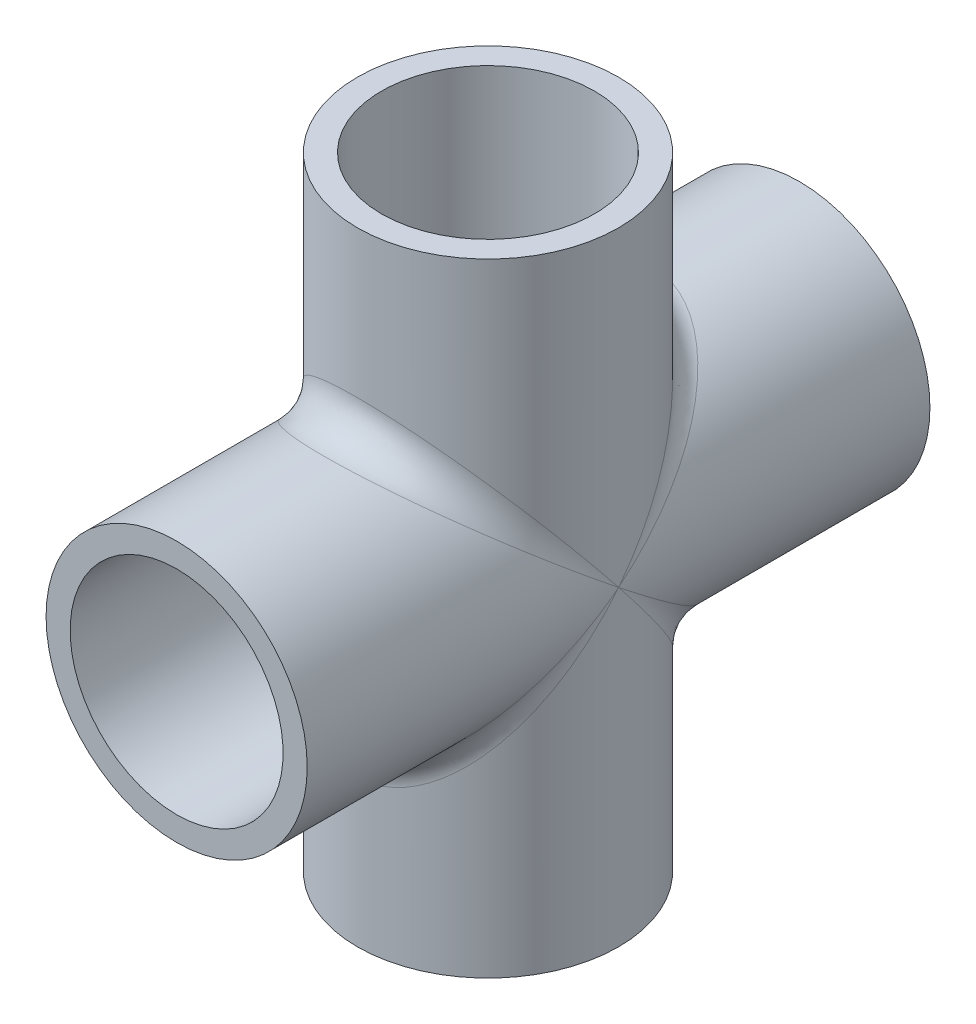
ISO-10303-21;
HEADER;
FILE_DESCRIPTION(('STEP AP214'),'2;1');
FILE_NAME('part.step','',(''),(''),'','','');
FILE_SCHEMA(('AUTOMOTIVE_DESIGN { 1 0 10303 214 1 1 1 1 }'));
ENDSEC;
DATA;
#1=APPLICATION_CONTEXT('core data for automotive mechanical design processes');
#2=APPLICATION_PROTOCOL_DEFINITION('international standard','automotive_design',2000,#1);
#3=PRODUCT_CONTEXT('',#1,'mechanical');
#4=PRODUCT('Part','Part','',(#3));
#5=PRODUCT_RELATED_PRODUCT_CATEGORY('part','',(#4));
#6=PRODUCT_DEFINITION_FORMATION('','',#4);
#7=PRODUCT_DEFINITION_CONTEXT('part definition',#1,'design');
#8=PRODUCT_DEFINITION('design','',#6,#7);
#9=PRODUCT_DEFINITION_SHAPE('','',#8);
#10=(LENGTH_UNIT() NAMED_UNIT(*) SI_UNIT(.MILLI.,.METRE.));
#11=(NAMED_UNIT(*) PLANE_ANGLE_UNIT() SI_UNIT($,.RADIAN.));
#12=(NAMED_UNIT(*) SI_UNIT($,.STERADIAN.) SOLID_ANGLE_UNIT());
#13=UNCERTAINTY_MEASURE_WITH_UNIT(LENGTH_MEASURE(1.E-05),#10,'distance_accuracy_value','');
#14=(GEOMETRIC_REPRESENTATION_CONTEXT(3) GLOBAL_UNCERTAINTY_ASSIGNED_CONTEXT((#13)) GLOBAL_UNIT_ASSIGNED_CONTEXT((#10,
#11,#12)) REPRESENTATION_CONTEXT('',''));
#15=CARTESIAN_POINT('',(0.,0.,0.));
#16=DIRECTION('',(0.,0.,1.));
#17=DIRECTION('',(1.,0.,0.));
#18=AXIS2_PLACEMENT_3D('',#15,#16,#17);
#19=CARTESIAN_POINT('',(0.,0.,-49.2125));
#20=DIRECTION('',(0.,0.,-1.));
#21=DIRECTION('',(0.,1.,0.));
#22=AXIS2_PLACEMENT_3D('',#19,#20,#21);
#23=CYLINDRICAL_SURFACE('',#22,13.3223);
#24=CARTESIAN_POINT('',(0.,0.,-20.6375));
#25=DIRECTION('',(0.,0.,-1.));
#26=DIRECTION('',(0.,1.,0.));
#27=AXIS2_PLACEMENT_3D('',#24,#25,#26);
#28=CIRCLE('',#27,13.3223);
#29=CARTESIAN_POINT('',(0.,13.3223,-20.6375));
#30=VERTEX_POINT('',#29);
#31=EDGE_CURVE('E382',#30,#30,#28,.T.);
#32=ORIENTED_EDGE('',*,*,#31,.T.);
#33=EDGE_LOOP('',(#32));
#34=FACE_BOUND('',#33,.T.);
#35=CARTESIAN_POINT('',(0.,0.,0.));
#36=DIRECTION('',(0.,-0.707106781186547,-0.707106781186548));
#37=DIRECTION('',(0.,0.707106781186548,-0.707106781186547));
#38=AXIS2_PLACEMENT_3D('',#35,#36,#37);
#39=ELLIPSE('',#38,18.8405773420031,13.3223);
#40=CARTESIAN_POINT('',(13.3223,0.,0.));
#41=VERTEX_POINT('',#40);
#42=CARTESIAN_POINT('',(-13.3223,0.,0.));
#43=VERTEX_POINT('',#42);
#44=EDGE_CURVE('E57',#41,#43,#39,.F.);
#45=ORIENTED_EDGE('',*,*,#44,.T.);
#46=CARTESIAN_POINT('',(0.,0.,0.));
#47=DIRECTION('',(0.,0.707106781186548,-0.707106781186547));
#48=DIRECTION('',(0.,-0.707106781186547,-0.707106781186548));
#49=AXIS2_PLACEMENT_3D('',#46,#47,#48);
#50=ELLIPSE('',#49,18.8405773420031,13.3223);
#51=EDGE_CURVE('E76',#43,#41,#50,.F.);
#52=ORIENTED_EDGE('',*,*,#51,.T.);
#53=EDGE_LOOP('',(#45,#52));
#54=FACE_BOUND('',#53,.T.);
#55=ADVANCED_FACE('F37',(#34,#54),#23,.F.);
#56=CARTESIAN_POINT('',(0.,0.,49.2125));
#57=DIRECTION('',(0.,0.,1.));
#58=DIRECTION('',(0.,-1.,0.));
#59=AXIS2_PLACEMENT_3D('',#56,#57,#58);
#60=PLANE('',#59);
#61=CARTESIAN_POINT('',(0.,0.,49.2125));
#62=DIRECTION('',(0.,0.,-1.));
#63=DIRECTION('',(0.,1.,0.));
#64=AXIS2_PLACEMENT_3D('',#61,#62,#63);
#65=CIRCLE('',#64,16.8275);
#66=CARTESIAN_POINT('',(0.,16.8275,49.2125));
#67=VERTEX_POINT('',#66);
#68=EDGE_CURVE('E197',#67,#67,#65,.T.);
#69=ORIENTED_EDGE('',*,*,#68,.T.);
#70=EDGE_LOOP('',(#69));
#71=FACE_BOUND('',#70,.T.);
#72=CARTESIAN_POINT('',(0.,0.,49.2125));
#73=DIRECTION('',(0.,0.,-1.));
#74=DIRECTION('',(0.,1.,0.));
#75=AXIS2_PLACEMENT_3D('',#72,#73,#74);
#76=CIRCLE('',#75,20.6375);
#77=CARTESIAN_POINT('',(0.,20.6375,49.2125));
#78=VERTEX_POINT('',#77);
#79=EDGE_CURVE('E83',#78,#78,#76,.T.);
#80=ORIENTED_EDGE('',*,*,#79,.F.);
#81=EDGE_LOOP('',(#80));
#82=FACE_BOUND('',#81,.T.);
#83=ADVANCED_FACE('F121',(#71,#82),#60,.T.);
#84=CARTESIAN_POINT('',(0.,0.,0.));
#85=DIRECTION('',(0.,0.,-1.));
#86=DIRECTION('',(0.,1.,0.));
#87=AXIS2_PLACEMENT_3D('',#84,#85,#86);
#88=CYLINDRICAL_SURFACE('',#87,20.6375);
#89=CARTESIAN_POINT('',(0.,0.,0.));
#90=DIRECTION('',(0.,0.782823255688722,-0.622244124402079));
#91=DIRECTION('',(0.,-0.622244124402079,-0.782823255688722));
#92=AXIS2_PLACEMENT_3D('',#89,#90,#91);
#93=ELLIPSE('',#92,33.166243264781,20.6375);
#94=CARTESIAN_POINT('',(20.6375,0.,0.));
#95=VERTEX_POINT('',#94);
#96=CARTESIAN_POINT('',(-20.6375,0.,0.));
#97=VERTEX_POINT('',#96);
#98=EDGE_CURVE('E64',#95,#97,#93,.F.);
#99=ORIENTED_EDGE('',*,*,#98,.T.);
#100=CARTESIAN_POINT('',(0.,0.,0.));
#101=DIRECTION('',(0.,0.782823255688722,0.622244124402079));
#102=DIRECTION('',(0.,-0.622244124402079,0.782823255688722));
#103=AXIS2_PLACEMENT_3D('',#100,#101,#102);
#104=ELLIPSE('',#103,33.166243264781,20.6375);
#105=EDGE_CURVE('E97',#97,#95,#104,.T.);
#106=ORIENTED_EDGE('',*,*,#105,.T.);
#107=EDGE_LOOP('',(#99,#106));
#108=FACE_BOUND('',#107,.T.);
#109=ORIENTED_EDGE('',*,*,#79,.T.);
#110=EDGE_LOOP('',(#109));
#111=FACE_BOUND('',#110,.T.);
#112=ADVANCED_FACE('F128',(#108,#111),#88,.T.);
#113=CARTESIAN_POINT('',(0.,-49.2125,-20.6375));
#114=DIRECTION('',(0.,-1.,0.));
#115=DIRECTION('',(0.,0.,-1.));
#116=AXIS2_PLACEMENT_3D('',#113,#114,#115);
#117=PLANE('',#116);
#118=CARTESIAN_POINT('',(0.,-49.2125,0.));
#119=DIRECTION('',(0.,1.,0.));
#120=DIRECTION('',(0.,0.,1.));
#121=AXIS2_PLACEMENT_3D('',#118,#119,#120);
#122=CIRCLE('',#121,16.8275);
#123=CARTESIAN_POINT('',(0.,-49.2125,16.8275));
#124=VERTEX_POINT('',#123);
#125=EDGE_CURVE('E192',#124,#124,#122,.T.);
#126=ORIENTED_EDGE('',*,*,#125,.T.);
#127=EDGE_LOOP('',(#126));
#128=FACE_BOUND('',#127,.T.);
#129=CARTESIAN_POINT('',(0.,-49.2125,0.));
#130=DIRECTION('',(0.,-1.,0.));
#131=DIRECTION('',(0.,0.,-1.));
#132=AXIS2_PLACEMENT_3D('',#129,#130,#131);
#133=CIRCLE('',#132,20.6375);
#134=CARTESIAN_POINT('',(0.,-49.2125,-20.6375));
#135=VERTEX_POINT('',#134);
#136=EDGE_CURVE('E195',#135,#135,#133,.T.);
#137=ORIENTED_EDGE('',*,*,#136,.T.);
#138=EDGE_LOOP('',(#137));
#139=FACE_BOUND('',#138,.T.);
#140=ADVANCED_FACE('F132',(#128,#139),#117,.T.);
#141=CARTESIAN_POINT('',(0.,0.,0.));
#142=DIRECTION('',(0.,-1.,0.));
#143=DIRECTION('',(0.,0.,-1.));
#144=AXIS2_PLACEMENT_3D('',#141,#142,#143);
#145=CYLINDRICAL_SURFACE('',#144,20.6375);
#146=ORIENTED_EDGE('',*,*,#136,.F.);
#147=EDGE_LOOP('',(#146));
#148=FACE_BOUND('',#147,.T.);
#149=CARTESIAN_POINT('',(0.,0.,0.));
#150=DIRECTION('',(0.,0.622244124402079,-0.782823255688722));
#151=DIRECTION('',(0.,-0.782823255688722,-0.622244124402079));
#152=AXIS2_PLACEMENT_3D('',#149,#150,#151);
#153=ELLIPSE('',#152,33.166243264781,20.6375);
#154=EDGE_CURVE('E85',#97,#95,#153,.F.);
#155=ORIENTED_EDGE('',*,*,#154,.T.);
#156=CARTESIAN_POINT('',(0.,0.,0.));
#157=DIRECTION('',(0.,0.622244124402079,0.782823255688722));
#158=DIRECTION('',(0.,-0.782823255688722,0.622244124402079));
#159=AXIS2_PLACEMENT_3D('',#156,#157,#158);
#160=ELLIPSE('',#159,33.166243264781,20.6375);
#161=EDGE_CURVE('E93',#95,#97,#160,.F.);
#162=ORIENTED_EDGE('',*,*,#161,.T.);
#163=EDGE_LOOP('',(#155,#162));
#164=FACE_BOUND('',#163,.T.);
#165=ADVANCED_FACE('F183',(#148,#164),#145,.T.);
#166=CARTESIAN_POINT('',(0.,20.6375,-49.2125));
#167=DIRECTION('',(0.,0.,-1.));
#168=DIRECTION('',(0.,1.,0.));
#169=AXIS2_PLACEMENT_3D('',#166,#167,#168);
#170=PLANE('',#169);
#171=CARTESIAN_POINT('',(0.,0.,-49.2125));
#172=DIRECTION('',(0.,0.,-1.));
#173=DIRECTION('',(0.,1.,0.));
#174=AXIS2_PLACEMENT_3D('',#171,#172,#173);
#175=CIRCLE('',#174,16.8275);
#176=CARTESIAN_POINT('',(0.,16.8275,-49.2125));
#177=VERTEX_POINT('',#176);
#178=EDGE_CURVE('E380',#177,#177,#175,.T.);
#179=ORIENTED_EDGE('',*,*,#178,.F.);
#180=EDGE_LOOP('',(#179));
#181=FACE_BOUND('',#180,.T.);
#182=CARTESIAN_POINT('',(0.,0.,-49.2125));
#183=DIRECTION('',(0.,0.,-1.));
#184=DIRECTION('',(0.,1.,0.));
#185=AXIS2_PLACEMENT_3D('',#182,#183,#184);
#186=CIRCLE('',#185,20.6375);
#187=CARTESIAN_POINT('',(0.,20.6375,-49.2125));
#188=VERTEX_POINT('',#187);
#189=EDGE_CURVE('E200',#188,#188,#186,.T.);
#190=ORIENTED_EDGE('',*,*,#189,.T.);
#191=EDGE_LOOP('',(#190));
#192=FACE_BOUND('',#191,.T.);
#193=ADVANCED_FACE('F135',(#181,#192),#170,.T.);
#194=CARTESIAN_POINT('',(0.,0.,0.));
#195=DIRECTION('',(0.,0.782823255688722,0.622244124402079));
#196=DIRECTION('',(0.,-0.622244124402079,0.782823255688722));
#197=AXIS2_PLACEMENT_3D('',#194,#195,#196);
#198=ELLIPSE('',#197,33.166243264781,20.6375);
#199=EDGE_CURVE('E100',#97,#95,#198,.F.);
#200=ORIENTED_EDGE('',*,*,#199,.T.);
#201=CARTESIAN_POINT('',(0.,0.,0.));
#202=DIRECTION('',(0.,0.782823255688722,-0.622244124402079));
#203=DIRECTION('',(0.,-0.622244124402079,-0.782823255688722));
#204=AXIS2_PLACEMENT_3D('',#201,#202,#203);
#205=ELLIPSE('',#204,33.166243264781,20.6375);
#206=EDGE_CURVE('E103',#95,#97,#205,.T.);
#207=ORIENTED_EDGE('',*,*,#206,.T.);
#208=EDGE_LOOP('',(#200,#207));
#209=FACE_BOUND('',#208,.T.);
#210=ORIENTED_EDGE('',*,*,#189,.F.);
#211=EDGE_LOOP('',(#210));
#212=FACE_BOUND('',#211,.T.);
#213=ADVANCED_FACE('F134',(#209,#212),#88,.T.);
#214=CARTESIAN_POINT('',(0.,49.2125,0.));
#215=DIRECTION('',(0.,1.,0.));
#216=DIRECTION('',(0.,0.,1.));
#217=AXIS2_PLACEMENT_3D('',#214,#215,#216);
#218=PLANE('',#217);
#219=CARTESIAN_POINT('',(0.,49.2125,0.));
#220=DIRECTION('',(0.,1.,0.));
#221=DIRECTION('',(0.,0.,1.));
#222=AXIS2_PLACEMENT_3D('',#219,#220,#221);
#223=CIRCLE('',#222,16.8275);
#224=CARTESIAN_POINT('',(0.,49.2125,16.8275));
#225=VERTEX_POINT('',#224);
#226=EDGE_CURVE('E407',#225,#225,#223,.T.);
#227=ORIENTED_EDGE('',*,*,#226,.F.);
#228=EDGE_LOOP('',(#227));
#229=FACE_BOUND('',#228,.T.);
#230=CARTESIAN_POINT('',(0.,49.2125,0.));
#231=DIRECTION('',(0.,-1.,0.));
#232=DIRECTION('',(0.,0.,-1.));
#233=AXIS2_PLACEMENT_3D('',#230,#231,#232);
#234=CIRCLE('',#233,20.6375);
#235=CARTESIAN_POINT('',(0.,49.2125,-20.6375));
#236=VERTEX_POINT('',#235);
#237=EDGE_CURVE('E196',#236,#236,#234,.T.);
#238=ORIENTED_EDGE('',*,*,#237,.F.);
#239=EDGE_LOOP('',(#238));
#240=FACE_BOUND('',#239,.T.);
#241=ADVANCED_FACE('F217',(#229,#240),#218,.T.);
#242=CARTESIAN_POINT('',(0.,0.,0.));
#243=DIRECTION('',(0.,0.622244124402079,-0.782823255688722));
#244=DIRECTION('',(0.,-0.782823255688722,-0.622244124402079));
#245=AXIS2_PLACEMENT_3D('',#242,#243,#244);
#246=ELLIPSE('',#245,33.166243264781,20.6375);
#247=EDGE_CURVE('E50',#97,#95,#246,.T.);
#248=ORIENTED_EDGE('',*,*,#247,.T.);
#249=CARTESIAN_POINT('',(0.,0.,0.));
#250=DIRECTION('',(0.,0.622244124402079,0.782823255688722));
#251=DIRECTION('',(0.,-0.782823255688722,0.622244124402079));
#252=AXIS2_PLACEMENT_3D('',#249,#250,#251);
#253=ELLIPSE('',#252,33.166243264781,20.6375);
#254=EDGE_CURVE('E11',#95,#97,#253,.T.);
#255=ORIENTED_EDGE('',*,*,#254,.T.);
#256=EDGE_LOOP('',(#248,#255));
#257=FACE_BOUND('',#256,.T.);
#258=ORIENTED_EDGE('',*,*,#237,.T.);
#259=EDGE_LOOP('',(#258));
#260=FACE_BOUND('',#259,.T.);
#261=ADVANCED_FACE('F124',(#257,#260),#145,.T.);
#262=CARTESIAN_POINT('',(0.,0.,-49.2125));
#263=DIRECTION('',(0.,0.,-1.));
#264=DIRECTION('',(0.,1.,0.));
#265=AXIS2_PLACEMENT_3D('',#262,#263,#264);
#266=CYLINDRICAL_SURFACE('',#265,16.8275);
#267=ORIENTED_EDGE('',*,*,#68,.F.);
#268=EDGE_LOOP('',(#267));
#269=FACE_BOUND('',#268,.T.);
#270=CARTESIAN_POINT('',(0.,0.,20.6375));
#271=DIRECTION('',(0.,0.,-1.));
#272=DIRECTION('',(0.,1.,0.));
#273=AXIS2_PLACEMENT_3D('',#270,#271,#272);
#274=CIRCLE('',#273,16.8275);
#275=CARTESIAN_POINT('',(0.,16.8275,20.6375));
#276=VERTEX_POINT('',#275);
#277=EDGE_CURVE('E203',#276,#276,#274,.T.);
#278=ORIENTED_EDGE('',*,*,#277,.T.);
#279=EDGE_LOOP('',(#278));
#280=FACE_BOUND('',#279,.T.);
#281=ADVANCED_FACE('F174',(#269,#280),#266,.F.);
#282=CARTESIAN_POINT('',(0.,16.8275,20.6375));
#283=DIRECTION('',(0.,0.,-1.));
#284=DIRECTION('',(0.,1.,0.));
#285=AXIS2_PLACEMENT_3D('',#282,#283,#284);
#286=PLANE('',#285);
#287=ORIENTED_EDGE('',*,*,#277,.F.);
#288=EDGE_LOOP('',(#287));
#289=FACE_BOUND('',#288,.T.);
#290=CARTESIAN_POINT('',(0.,0.,20.6375));
#291=DIRECTION('',(0.,0.,-1.));
#292=DIRECTION('',(0.,1.,0.));
#293=AXIS2_PLACEMENT_3D('',#290,#291,#292);
#294=CIRCLE('',#293,13.3223);
#295=CARTESIAN_POINT('',(0.,13.3223,20.6375));
#296=VERTEX_POINT('',#295);
#297=EDGE_CURVE('E389',#296,#296,#294,.T.);
#298=ORIENTED_EDGE('',*,*,#297,.T.);
#299=EDGE_LOOP('',(#298));
#300=FACE_BOUND('',#299,.T.);
#301=ADVANCED_FACE('F165',(#289,#300),#286,.F.);
#302=CARTESIAN_POINT('',(0.,0.,0.));
#303=DIRECTION('',(0.,-0.707106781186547,-0.707106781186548));
#304=DIRECTION('',(0.,0.707106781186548,-0.707106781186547));
#305=AXIS2_PLACEMENT_3D('',#302,#303,#304);
#306=ELLIPSE('',#305,18.8405773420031,13.3223);
#307=EDGE_CURVE('E74',#41,#43,#306,.T.);
#308=ORIENTED_EDGE('',*,*,#307,.T.);
#309=CARTESIAN_POINT('',(0.,0.,0.));
#310=DIRECTION('',(0.,0.707106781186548,-0.707106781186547));
#311=DIRECTION('',(0.,-0.707106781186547,-0.707106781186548));
#312=AXIS2_PLACEMENT_3D('',#309,#310,#311);
#313=ELLIPSE('',#312,18.8405773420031,13.3223);
#314=EDGE_CURVE('E79',#43,#41,#313,.T.);
#315=ORIENTED_EDGE('',*,*,#314,.T.);
#316=EDGE_LOOP('',(#308,#315));
#317=FACE_BOUND('',#316,.T.);
#318=ORIENTED_EDGE('',*,*,#297,.F.);
#319=EDGE_LOOP('',(#318));
#320=FACE_BOUND('',#319,.T.);
#321=ADVANCED_FACE('F87',(#317,#320),#23,.F.);
#322=CARTESIAN_POINT('',(0.,13.3223,-20.6375));
#323=DIRECTION('',(0.,0.,1.));
#324=DIRECTION('',(0.,-1.,0.));
#325=AXIS2_PLACEMENT_3D('',#322,#323,#324);
#326=PLANE('',#325);
#327=ORIENTED_EDGE('',*,*,#31,.F.);
#328=EDGE_LOOP('',(#327));
#329=FACE_BOUND('',#328,.T.);
#330=CARTESIAN_POINT('',(0.,0.,-20.6375));
#331=DIRECTION('',(0.,0.,-1.));
#332=DIRECTION('',(0.,1.,0.));
#333=AXIS2_PLACEMENT_3D('',#330,#331,#332);
#334=CIRCLE('',#333,16.8275);
#335=CARTESIAN_POINT('',(0.,16.8275,-20.6375));
#336=VERTEX_POINT('',#335);
#337=EDGE_CURVE('E377',#336,#336,#334,.T.);
#338=ORIENTED_EDGE('',*,*,#337,.T.);
#339=EDGE_LOOP('',(#338));
#340=FACE_BOUND('',#339,.T.);
#341=ADVANCED_FACE('F164',(#329,#340),#326,.F.);
#342=CARTESIAN_POINT('',(0.,0.,-49.2125));
#343=DIRECTION('',(0.,0.,-1.));
#344=DIRECTION('',(0.,1.,0.));
#345=AXIS2_PLACEMENT_3D('',#342,#343,#344);
#346=CYLINDRICAL_SURFACE('',#345,16.8275);
#347=ORIENTED_EDGE('',*,*,#337,.F.);
#348=EDGE_LOOP('',(#347));
#349=FACE_BOUND('',#348,.T.);
#350=ORIENTED_EDGE('',*,*,#178,.T.);
#351=EDGE_LOOP('',(#350));
#352=FACE_BOUND('',#351,.T.);
#353=ADVANCED_FACE('F171',(#349,#352),#346,.F.);
#354=CARTESIAN_POINT('',(0.,49.2125,0.));
#355=DIRECTION('',(0.,1.,0.));
#356=DIRECTION('',(0.,0.,1.));
#357=AXIS2_PLACEMENT_3D('',#354,#355,#356);
#358=CYLINDRICAL_SURFACE('',#357,16.8275);
#359=CARTESIAN_POINT('',(0.,20.6375,0.));
#360=DIRECTION('',(0.,1.,0.));
#361=DIRECTION('',(0.,0.,1.));
#362=AXIS2_PLACEMENT_3D('',#359,#360,#361);
#363=CIRCLE('',#362,16.8275);
#364=CARTESIAN_POINT('',(0.,20.6375,16.8275));
#365=VERTEX_POINT('',#364);
#366=EDGE_CURVE('E404',#365,#365,#363,.T.);
#367=ORIENTED_EDGE('',*,*,#366,.F.);
#368=EDGE_LOOP('',(#367));
#369=FACE_BOUND('',#368,.T.);
#370=ORIENTED_EDGE('',*,*,#226,.T.);
#371=EDGE_LOOP('',(#370));
#372=FACE_BOUND('',#371,.T.);
#373=ADVANCED_FACE('F323',(#369,#372),#358,.F.);
#374=CARTESIAN_POINT('',(0.,20.6375,13.3223));
#375=DIRECTION('',(0.,-1.,0.));
#376=DIRECTION('',(0.,0.,-1.));
#377=AXIS2_PLACEMENT_3D('',#374,#375,#376);
#378=PLANE('',#377);
#379=CARTESIAN_POINT('',(0.,20.6375,0.));
#380=DIRECTION('',(0.,1.,0.));
#381=DIRECTION('',(0.,0.,1.));
#382=AXIS2_PLACEMENT_3D('',#379,#380,#381);
#383=CIRCLE('',#382,13.3223);
#384=CARTESIAN_POINT('',(0.,20.6375,13.3223));
#385=VERTEX_POINT('',#384);
#386=EDGE_CURVE('E401',#385,#385,#383,.T.);
#387=ORIENTED_EDGE('',*,*,#386,.F.);
#388=EDGE_LOOP('',(#387));
#389=FACE_BOUND('',#388,.T.);
#390=ORIENTED_EDGE('',*,*,#366,.T.);
#391=EDGE_LOOP('',(#390));
#392=FACE_BOUND('',#391,.T.);
#393=ADVANCED_FACE('F316',(#389,#392),#378,.F.);
#394=CARTESIAN_POINT('',(0.,49.2125,0.));
#395=DIRECTION('',(0.,1.,0.));
#396=DIRECTION('',(0.,0.,1.));
#397=AXIS2_PLACEMENT_3D('',#394,#395,#396);
#398=CYLINDRICAL_SURFACE('',#397,13.3223);
#399=ORIENTED_EDGE('',*,*,#386,.T.);
#400=EDGE_LOOP('',(#399));
#401=FACE_BOUND('',#400,.T.);
#402=ORIENTED_EDGE('',*,*,#44,.F.);
#403=ORIENTED_EDGE('',*,*,#314,.F.);
#404=EDGE_LOOP('',(#402,#403));
#405=FACE_BOUND('',#404,.T.);
#406=ADVANCED_FACE('F82',(#401,#405),#398,.F.);
#407=CARTESIAN_POINT('',(0.,-20.6375,0.));
#408=DIRECTION('',(0.,1.,0.));
#409=DIRECTION('',(0.,0.,1.));
#410=AXIS2_PLACEMENT_3D('',#407,#408,#409);
#411=CIRCLE('',#410,13.3223);
#412=CARTESIAN_POINT('',(0.,-20.6375,13.3223));
#413=VERTEX_POINT('',#412);
#414=EDGE_CURVE('E398',#413,#413,#411,.T.);
#415=ORIENTED_EDGE('',*,*,#414,.F.);
#416=EDGE_LOOP('',(#415));
#417=FACE_BOUND('',#416,.T.);
#418=ORIENTED_EDGE('',*,*,#307,.F.);
#419=ORIENTED_EDGE('',*,*,#51,.F.);
#420=EDGE_LOOP('',(#418,#419));
#421=FACE_BOUND('',#420,.T.);
#422=ADVANCED_FACE('F75',(#417,#421),#398,.F.);
#423=CARTESIAN_POINT('',(0.,49.2125,0.));
#424=DIRECTION('',(0.,1.,0.));
#425=DIRECTION('',(0.,0.,1.));
#426=AXIS2_PLACEMENT_3D('',#423,#424,#425);
#427=CYLINDRICAL_SURFACE('',#426,16.8275);
#428=ORIENTED_EDGE('',*,*,#125,.F.);
#429=EDGE_LOOP('',(#428));
#430=FACE_BOUND('',#429,.T.);
#431=CARTESIAN_POINT('',(0.,-20.6375,0.));
#432=DIRECTION('',(0.,1.,0.));
#433=DIRECTION('',(0.,0.,1.));
#434=AXIS2_PLACEMENT_3D('',#431,#432,#433);
#435=CIRCLE('',#434,16.8275);
#436=CARTESIAN_POINT('',(0.,-20.6375,16.8275));
#437=VERTEX_POINT('',#436);
#438=EDGE_CURVE('E384',#437,#437,#435,.T.);
#439=ORIENTED_EDGE('',*,*,#438,.T.);
#440=EDGE_LOOP('',(#439));
#441=FACE_BOUND('',#440,.T.);
#442=ADVANCED_FACE('F294',(#430,#441),#427,.F.);
#443=CARTESIAN_POINT('',(0.,-20.6375,16.8275));
#444=DIRECTION('',(0.,1.,0.));
#445=DIRECTION('',(0.,0.,1.));
#446=AXIS2_PLACEMENT_3D('',#443,#444,#445);
#447=PLANE('',#446);
#448=ORIENTED_EDGE('',*,*,#438,.F.);
#449=EDGE_LOOP('',(#448));
#450=FACE_BOUND('',#449,.T.);
#451=ORIENTED_EDGE('',*,*,#414,.T.);
#452=EDGE_LOOP('',(#451));
#453=FACE_BOUND('',#452,.T.);
#454=ADVANCED_FACE('F119',(#450,#453),#447,.F.);
#455=CARTESIAN_POINT('',(20.6375,0.,0.));
#456=CARTESIAN_POINT('',(20.6375,0.,0.));
#457=CARTESIAN_POINT('',(20.6375,0.,0.));
#458=CARTESIAN_POINT('',(20.6374767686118,-0.565599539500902,0.449579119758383));
#459=CARTESIAN_POINT('',(20.6375718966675,-0.50759429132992,0.507594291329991));
#460=CARTESIAN_POINT('',(20.6374767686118,-0.449579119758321,0.565599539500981));
#461=CARTESIAN_POINT('',(20.6228079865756,-1.13120176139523,0.899160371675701));
#462=CARTESIAN_POINT('',(20.6190127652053,-1.0155433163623,1.01554331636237));
#463=CARTESIAN_POINT('',(20.6228079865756,-0.899160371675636,1.13120176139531));
#464=CARTESIAN_POINT('',(20.5640128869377,-2.2612389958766,1.79739509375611));
#465=CARTESIAN_POINT('',(20.545023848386,-2.02893265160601,2.02893265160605));
#466=CARTESIAN_POINT('',(20.5640128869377,-1.79739509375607,2.26123899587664));
#467=CARTESIAN_POINT('',(20.5198841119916,-2.82567390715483,2.24604848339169));
#468=CARTESIAN_POINT('',(20.4894855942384,-2.53509169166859,2.5350916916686));
#469=CARTESIAN_POINT('',(20.5198841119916,-2.24604848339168,2.82567390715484));
#470=CARTESIAN_POINT('',(20.4025047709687,-3.94731003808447,3.13760540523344));
#471=CARTESIAN_POINT('',(20.3420892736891,-3.53869435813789,3.53869435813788));
#472=CARTESIAN_POINT('',(20.4025047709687,-3.13760540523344,3.94731003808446));
#473=CARTESIAN_POINT('',(20.3295055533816,-4.50453191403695,3.58052535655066));
#474=CARTESIAN_POINT('',(20.2503359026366,-4.03688011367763,4.03688011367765));
#475=CARTESIAN_POINT('',(20.3295055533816,-3.58052535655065,4.50453191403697));
#476=CARTESIAN_POINT('',(20.1540835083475,-5.6152378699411,4.46339419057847));
#477=CARTESIAN_POINT('',(20.0305470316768,-5.02697604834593,5.02697604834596));
#478=CARTESIAN_POINT('',(20.1540835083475,-4.46339419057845,5.61523786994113));
#479=CARTESIAN_POINT('',(20.0516613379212,-6.16872203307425,4.90334313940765));
#480=CARTESIAN_POINT('',(19.9022031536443,-5.51955473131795,5.51955473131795));
#481=CARTESIAN_POINT('',(20.0516613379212,-4.90334313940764,6.16872203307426));
#482=CARTESIAN_POINT('',(19.7035588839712,-7.80317471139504,6.20252346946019));
#483=CARTESIAN_POINT('',(19.4662002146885,-6.97252318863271,6.97252318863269));
#484=CARTESIAN_POINT('',(19.7035588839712,-6.20252346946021,7.80317471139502));
#485=CARTESIAN_POINT('',(19.4150632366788,-8.8772446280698,7.05627134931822));
#486=CARTESIAN_POINT('',(19.1049676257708,-7.92104823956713,7.92104823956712));
#487=CARTESIAN_POINT('',(19.4150632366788,-7.05627134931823,8.87724462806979));
#488=CARTESIAN_POINT('',(18.7266495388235,-10.9681348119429,8.71826097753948));
#489=CARTESIAN_POINT('',(18.2541900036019,-9.74370139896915,9.74370139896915));
#490=CARTESIAN_POINT('',(18.7266495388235,-8.71826097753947,10.9681348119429));
#491=CARTESIAN_POINT('',(18.3296513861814,-11.9857135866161,9.52710564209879));
#492=CARTESIAN_POINT('',(17.7634241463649,-10.6233299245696,10.6233299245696));
#493=CARTESIAN_POINT('',(18.3296513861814,-9.52710564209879,11.9857135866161));
#494=CARTESIAN_POINT('',(17.4300951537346,-13.9458921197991,11.0851962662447));
#495=CARTESIAN_POINT('',(16.6698728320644,-12.2876883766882,12.2876883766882));
#496=CARTESIAN_POINT('',(17.4300951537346,-11.0851962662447,13.9458921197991));
#497=CARTESIAN_POINT('',(16.9312992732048,-14.8898475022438,11.8355197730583));
#498=CARTESIAN_POINT('',(16.0655616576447,-13.0775741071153,13.0775741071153));
#499=CARTESIAN_POINT('',(16.9312992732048,-11.8355197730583,14.8898475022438));
#500=CARTESIAN_POINT('',(15.8355780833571,-16.6862843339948,13.2634567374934));
#501=CARTESIAN_POINT('',(14.7664997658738,-14.5443602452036,14.5443602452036));
#502=CARTESIAN_POINT('',(15.8355780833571,-13.2634567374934,16.6862843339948));
#503=CARTESIAN_POINT('',(15.2431010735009,-17.5408785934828,13.942749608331));
#504=CARTESIAN_POINT('',(14.0700930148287,-15.2258699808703,15.2258699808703));
#505=CARTESIAN_POINT('',(15.2431010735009,-13.942749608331,17.5408785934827));
#506=CARTESIAN_POINT('',(14.2815207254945,-18.7505746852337,14.9043029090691));
#507=CARTESIAN_POINT('',(12.9790417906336,-16.1528786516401,16.1528786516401));
#508=CARTESIAN_POINT('',(14.2815207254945,-14.9043029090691,18.7505746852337));
#509=CARTESIAN_POINT('',(13.9568883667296,-19.133914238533,15.2090087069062));
#510=CARTESIAN_POINT('',(12.6113820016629,-16.44375216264,16.44375216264));
#511=CARTESIAN_POINT('',(13.9568883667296,-15.2090087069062,19.133914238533));
#512=CARTESIAN_POINT('',(13.2805969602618,-19.8812003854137,15.8030053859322));
#513=CARTESIAN_POINT('',(11.85610596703,-17.0003134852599,17.0003134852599));
#514=CARTESIAN_POINT('',(13.2805969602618,-15.8030053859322,19.8812003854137));
#515=CARTESIAN_POINT('',(12.9289363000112,-20.2451458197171,16.0922953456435));
#516=CARTESIAN_POINT('',(11.4680220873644,-17.2657332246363,17.2657332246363));
#517=CARTESIAN_POINT('',(12.9289363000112,-16.0922953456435,20.2451458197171));
#518=CARTESIAN_POINT('',(11.8653214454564,-21.2718384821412,16.9083843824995));
#519=CARTESIAN_POINT('',(10.305604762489,-18.0027606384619,18.0027606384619));
#520=CARTESIAN_POINT('',(11.8653214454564,-16.9083843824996,21.2718384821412));
#521=CARTESIAN_POINT('',(11.1164458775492,-21.9054559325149,17.412029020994));
#522=CARTESIAN_POINT('',(9.514775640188,-18.4302990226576,18.4302990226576));
#523=CARTESIAN_POINT('',(11.1164458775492,-17.412029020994,21.9054559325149));
#524=CARTESIAN_POINT('',(9.93714634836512,-22.7620707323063,18.0929279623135));
#525=CARTESIAN_POINT('',(8.33254069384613,-18.9735669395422,18.9735669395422));
#526=CARTESIAN_POINT('',(9.93714634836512,-18.0929279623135,22.7620707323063));
#527=CARTESIAN_POINT('',(9.54437018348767,-23.0268569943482,18.3033990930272));
#528=CARTESIAN_POINT('',(7.94349956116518,-19.1369787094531,19.1369787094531));
#529=CARTESIAN_POINT('',(9.54437018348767,-18.3033990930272,23.0268569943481));
#530=CARTESIAN_POINT('',(8.73702466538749,-23.52860594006,18.7022251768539));
#531=CARTESIAN_POINT('',(7.1619072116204,-19.4370130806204,19.4370130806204));
#532=CARTESIAN_POINT('',(8.73702466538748,-18.7022251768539,23.52860594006));
#533=CARTESIAN_POINT('',(8.32246508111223,-23.7655809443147,18.8905899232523));
#534=CARTESIAN_POINT('',(6.76962423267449,-19.5731321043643,19.5731321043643));
#535=CARTESIAN_POINT('',(8.32246508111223,-18.8905899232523,23.7655809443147));
#536=CARTESIAN_POINT('',(7.48936532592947,-24.1997183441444,19.2356734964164));
#537=CARTESIAN_POINT('',(6.00093532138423,-19.8138885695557,19.8138885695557));
#538=CARTESIAN_POINT('',(7.48936532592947,-19.2356734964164,24.1997183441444));
#539=CARTESIAN_POINT('',(7.07161121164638,-24.3980731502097,19.3933401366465));
#540=CARTESIAN_POINT('',(5.62476979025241,-19.9191300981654,19.9191300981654));
#541=CARTESIAN_POINT('',(7.07161121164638,-19.3933401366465,24.3980731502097));
#542=CARTESIAN_POINT('',(6.21883816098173,-24.7629543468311,19.683373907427));
#543=CARTESIAN_POINT('',(4.87577662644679,-20.1060539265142,20.1060539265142));
#544=CARTESIAN_POINT('',(6.21883816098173,-19.683373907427,24.7629543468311));
#545=CARTESIAN_POINT('',(5.78382016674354,-24.9294824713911,19.8157424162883));
#546=CARTESIAN_POINT('',(4.50360099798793,-20.1872975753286,20.1872975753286));
#547=CARTESIAN_POINT('',(5.78382016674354,-19.8157424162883,24.9294824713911));
#548=CARTESIAN_POINT('',(4.91215064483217,-25.2233195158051,20.0493051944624));
#549=CARTESIAN_POINT('',(3.77577955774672,-20.3258403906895,20.3258403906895));
#550=CARTESIAN_POINT('',(4.91215064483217,-20.0493051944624,25.2233195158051));
#551=CARTESIAN_POINT('',(4.47593597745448,-25.3516512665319,20.1513124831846));
#552=CARTESIAN_POINT('',(3.42063320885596,-20.3834536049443,20.3834536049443));
#553=CARTESIAN_POINT('',(4.47593597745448,-20.1513124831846,25.3516512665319));
#554=CARTESIAN_POINT('',(3.59235266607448,-25.5732145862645,20.327426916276));
#555=CARTESIAN_POINT('',(2.71594108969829,-20.4801418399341,20.4801418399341));
#556=CARTESIAN_POINT('',(3.59235266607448,-20.327426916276,25.5732145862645));
#557=CARTESIAN_POINT('',(3.14498452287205,-25.66644772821,20.4015353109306));
#558=CARTESIAN_POINT('',(2.36727578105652,-20.5189525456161,20.5189525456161));
#559=CARTESIAN_POINT('',(3.14498452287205,-20.4015353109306,25.6664477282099));
#560=CARTESIAN_POINT('',(2.24984348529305,-25.8147070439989,20.5193824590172));
#561=CARTESIAN_POINT('',(1.68019518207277,-20.5795107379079,20.5795107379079));
#562=CARTESIAN_POINT('',(2.24984348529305,-20.5193824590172,25.8147070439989));
#563=CARTESIAN_POINT('',(1.80219618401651,-25.8703315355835,20.5635967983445));
#564=CARTESIAN_POINT('',(1.34259658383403,-20.6013600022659,20.6013600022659));
#565=CARTESIAN_POINT('',(1.80219618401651,-20.5635967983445,25.8703315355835));
#566=CARTESIAN_POINT('',(0.903032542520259,-25.9446309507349,20.6226553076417));
#567=CARTESIAN_POINT('',(0.669523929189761,-20.6303958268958,20.6303958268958));
#568=CARTESIAN_POINT('',(0.903032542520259,-20.6226553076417,25.9446309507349));
#569=CARTESIAN_POINT('',(0.451516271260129,-25.9633065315,20.6375));
#570=CARTESIAN_POINT('',(0.335003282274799,-20.6375,20.6375));
#571=CARTESIAN_POINT('',(0.451516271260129,-20.6375,25.9633065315));
#572=CARTESIAN_POINT('',(-0.451516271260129,-25.9633065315,20.6375));
#573=CARTESIAN_POINT('',(-0.335003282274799,-20.6375,20.6375));
#574=CARTESIAN_POINT('',(-0.451516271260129,-20.6375,25.9633065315));
#575=CARTESIAN_POINT('',(-0.903032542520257,-25.9446309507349,20.6226553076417));
#576=CARTESIAN_POINT('',(-0.66952392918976,-20.6303958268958,20.6303958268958));
#577=CARTESIAN_POINT('',(-0.903032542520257,-20.6226553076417,25.9446309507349));
#578=CARTESIAN_POINT('',(-1.80219618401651,-25.8703315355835,20.5635967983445));
#579=CARTESIAN_POINT('',(-1.34259658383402,-20.6013600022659,20.6013600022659));
#580=CARTESIAN_POINT('',(-1.80219618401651,-20.5635967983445,25.8703315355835));
#581=CARTESIAN_POINT('',(-2.24984348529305,-25.8147070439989,20.5193824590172));
#582=CARTESIAN_POINT('',(-1.68019518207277,-20.5795107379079,20.5795107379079));
#583=CARTESIAN_POINT('',(-2.24984348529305,-20.5193824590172,25.8147070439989));
#584=CARTESIAN_POINT('',(-3.14498452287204,-25.66644772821,20.4015353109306));
#585=CARTESIAN_POINT('',(-2.36727578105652,-20.5189525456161,20.5189525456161));
#586=CARTESIAN_POINT('',(-3.14498452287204,-20.4015353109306,25.6664477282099));
#587=CARTESIAN_POINT('',(-3.59235266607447,-25.5732145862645,20.327426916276));
#588=CARTESIAN_POINT('',(-2.71594108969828,-20.4801418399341,20.4801418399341));
#589=CARTESIAN_POINT('',(-3.59235266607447,-20.327426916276,25.5732145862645));
#590=CARTESIAN_POINT('',(-4.47593597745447,-25.3516512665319,20.1513124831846));
#591=CARTESIAN_POINT('',(-3.42063320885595,-20.3834536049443,20.3834536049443));
#592=CARTESIAN_POINT('',(-4.47593597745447,-20.1513124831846,25.3516512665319));
#593=CARTESIAN_POINT('',(-4.91215064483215,-25.2233195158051,20.0493051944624));
#594=CARTESIAN_POINT('',(-3.77577955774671,-20.3258403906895,20.3258403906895));
#595=CARTESIAN_POINT('',(-4.91215064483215,-20.0493051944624,25.2233195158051));
#596=CARTESIAN_POINT('',(-5.78382016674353,-24.9294824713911,19.8157424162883));
#597=CARTESIAN_POINT('',(-4.50360099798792,-20.1872975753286,20.1872975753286));
#598=CARTESIAN_POINT('',(-5.78382016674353,-19.8157424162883,24.9294824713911));
#599=CARTESIAN_POINT('',(-6.21883816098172,-24.7629543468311,19.683373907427));
#600=CARTESIAN_POINT('',(-4.87577662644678,-20.1060539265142,20.1060539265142));
#601=CARTESIAN_POINT('',(-6.21883816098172,-19.683373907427,24.7629543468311));
#602=CARTESIAN_POINT('',(-7.07161121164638,-24.3980731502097,19.3933401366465));
#603=CARTESIAN_POINT('',(-5.6247697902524,-19.9191300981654,19.9191300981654));
#604=CARTESIAN_POINT('',(-7.07161121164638,-19.3933401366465,24.3980731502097));
#605=CARTESIAN_POINT('',(-7.48936532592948,-24.1997183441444,19.2356734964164));
#606=CARTESIAN_POINT('',(-6.00093532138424,-19.8138885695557,19.8138885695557));
#607=CARTESIAN_POINT('',(-7.48936532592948,-19.2356734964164,24.1997183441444));
#608=CARTESIAN_POINT('',(-8.32246508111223,-23.7655809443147,18.8905899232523));
#609=CARTESIAN_POINT('',(-6.76962423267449,-19.5731321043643,19.5731321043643));
#610=CARTESIAN_POINT('',(-8.32246508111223,-18.8905899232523,23.7655809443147));
#611=CARTESIAN_POINT('',(-8.73702466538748,-23.52860594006,18.7022251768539));
#612=CARTESIAN_POINT('',(-7.1619072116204,-19.4370130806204,19.4370130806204));
#613=CARTESIAN_POINT('',(-8.73702466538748,-18.7022251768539,23.52860594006));
#614=CARTESIAN_POINT('',(-9.54437018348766,-23.0268569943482,18.3033990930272));
#615=CARTESIAN_POINT('',(-7.94349956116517,-19.1369787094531,19.1369787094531));
#616=CARTESIAN_POINT('',(-9.54437018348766,-18.3033990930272,23.0268569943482));
#617=CARTESIAN_POINT('',(-9.93714634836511,-22.7620707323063,18.0929279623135));
#618=CARTESIAN_POINT('',(-8.33254069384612,-18.9735669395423,18.9735669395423));
#619=CARTESIAN_POINT('',(-9.93714634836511,-18.0929279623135,22.7620707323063));
#620=CARTESIAN_POINT('',(-11.1164458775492,-21.9054559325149,17.412029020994));
#621=CARTESIAN_POINT('',(-9.51477564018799,-18.4302990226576,18.4302990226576));
#622=CARTESIAN_POINT('',(-11.1164458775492,-17.412029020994,21.9054559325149));
#623=CARTESIAN_POINT('',(-11.8653214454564,-21.2718384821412,16.9083843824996));
#624=CARTESIAN_POINT('',(-10.305604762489,-18.0027606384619,18.0027606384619));
#625=CARTESIAN_POINT('',(-11.8653214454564,-16.9083843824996,21.2718384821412));
#626=CARTESIAN_POINT('',(-12.9289363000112,-20.2451458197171,16.0922953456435));
#627=CARTESIAN_POINT('',(-11.4680220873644,-17.2657332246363,17.2657332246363));
#628=CARTESIAN_POINT('',(-12.9289363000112,-16.0922953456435,20.2451458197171));
#629=CARTESIAN_POINT('',(-13.2805969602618,-19.8812003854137,15.8030053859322));
#630=CARTESIAN_POINT('',(-11.85610596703,-17.0003134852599,17.0003134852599));
#631=CARTESIAN_POINT('',(-13.2805969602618,-15.8030053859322,19.8812003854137));
#632=CARTESIAN_POINT('',(-13.9568883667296,-19.133914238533,15.2090087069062));
#633=CARTESIAN_POINT('',(-12.6113820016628,-16.44375216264,16.44375216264));
#634=CARTESIAN_POINT('',(-13.9568883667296,-15.2090087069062,19.133914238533));
#635=CARTESIAN_POINT('',(-14.2815207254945,-18.7505746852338,14.9043029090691));
#636=CARTESIAN_POINT('',(-12.9790417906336,-16.1528786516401,16.1528786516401));
#637=CARTESIAN_POINT('',(-14.2815207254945,-14.9043029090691,18.7505746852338));
#638=CARTESIAN_POINT('',(-15.2431010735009,-17.5408785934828,13.942749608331));
#639=CARTESIAN_POINT('',(-14.0700930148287,-15.2258699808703,15.2258699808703));
#640=CARTESIAN_POINT('',(-15.2431010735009,-13.942749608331,17.5408785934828));
#641=CARTESIAN_POINT('',(-15.8355780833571,-16.6862843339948,13.2634567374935));
#642=CARTESIAN_POINT('',(-14.7664997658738,-14.5443602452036,14.5443602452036));
#643=CARTESIAN_POINT('',(-15.8355780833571,-13.2634567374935,16.6862843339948));
#644=CARTESIAN_POINT('',(-16.9312992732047,-14.8898475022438,11.8355197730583));
#645=CARTESIAN_POINT('',(-16.0655616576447,-13.0775741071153,13.0775741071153));
#646=CARTESIAN_POINT('',(-16.9312992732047,-11.8355197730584,14.8898475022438));
#647=CARTESIAN_POINT('',(-17.4300951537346,-13.9458921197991,11.0851962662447));
#648=CARTESIAN_POINT('',(-16.6698728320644,-12.2876883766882,12.2876883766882));
#649=CARTESIAN_POINT('',(-17.4300951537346,-11.0851962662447,13.9458921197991));
#650=CARTESIAN_POINT('',(-18.3296513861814,-11.9857135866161,9.5271056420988));
#651=CARTESIAN_POINT('',(-17.7634241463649,-10.6233299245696,10.6233299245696));
#652=CARTESIAN_POINT('',(-18.3296513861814,-9.5271056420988,11.9857135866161));
#653=CARTESIAN_POINT('',(-18.7266495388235,-10.9681348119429,8.71826097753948));
#654=CARTESIAN_POINT('',(-18.2541900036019,-9.74370139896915,9.74370139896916));
#655=CARTESIAN_POINT('',(-18.7266495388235,-8.71826097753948,10.9681348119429));
#656=CARTESIAN_POINT('',(-19.4150632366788,-8.87724462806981,7.05627134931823));
#657=CARTESIAN_POINT('',(-19.1049676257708,-7.92104823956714,7.92104823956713));
#658=CARTESIAN_POINT('',(-19.4150632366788,-7.05627134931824,8.8772446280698));
#659=CARTESIAN_POINT('',(-19.7035588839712,-7.80317471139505,6.2025234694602));
#660=CARTESIAN_POINT('',(-19.4662002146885,-6.97252318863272,6.9725231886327));
#661=CARTESIAN_POINT('',(-19.7035588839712,-6.20252346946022,7.80317471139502));
#662=CARTESIAN_POINT('',(-20.0516613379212,-6.16872203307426,4.90334313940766));
#663=CARTESIAN_POINT('',(-19.9022031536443,-5.51955473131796,5.51955473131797));
#664=CARTESIAN_POINT('',(-20.0516613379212,-4.90334313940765,6.16872203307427));
#665=CARTESIAN_POINT('',(-20.1540835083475,-5.61523786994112,4.46339419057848));
#666=CARTESIAN_POINT('',(-20.0305470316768,-5.02697604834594,5.02697604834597));
#667=CARTESIAN_POINT('',(-20.1540835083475,-4.46339419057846,5.61523786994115));
#668=CARTESIAN_POINT('',(-20.3295055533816,-4.50453191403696,3.58052535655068));
#669=CARTESIAN_POINT('',(-20.2503359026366,-4.03688011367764,4.03688011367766));
#670=CARTESIAN_POINT('',(-20.3295055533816,-3.58052535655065,4.50453191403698));
#671=CARTESIAN_POINT('',(-20.4025047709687,-3.94731003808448,3.13760540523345));
#672=CARTESIAN_POINT('',(-20.3420892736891,-3.5386943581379,3.53869435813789));
#673=CARTESIAN_POINT('',(-20.4025047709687,-3.13760540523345,3.94731003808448));
#674=CARTESIAN_POINT('',(-20.5198841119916,-2.82567390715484,2.2460484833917));
#675=CARTESIAN_POINT('',(-20.4894855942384,-2.5350916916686,2.53509169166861));
#676=CARTESIAN_POINT('',(-20.5198841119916,-2.24604848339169,2.82567390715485));
#677=CARTESIAN_POINT('',(-20.5640128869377,-2.26123899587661,1.79739509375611));
#678=CARTESIAN_POINT('',(-20.545023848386,-2.02893265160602,2.02893265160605));
#679=CARTESIAN_POINT('',(-20.5640128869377,-1.79739509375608,2.26123899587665));
#680=CARTESIAN_POINT('',(-20.6228079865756,-1.13120176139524,0.899160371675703));
#681=CARTESIAN_POINT('',(-20.6190127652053,-1.01554331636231,1.01554331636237));
#682=CARTESIAN_POINT('',(-20.6228079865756,-0.899160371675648,1.13120176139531));
#683=CARTESIAN_POINT('',(-20.6374767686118,-0.565599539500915,0.449579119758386));
#684=CARTESIAN_POINT('',(-20.6375718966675,-0.507594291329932,0.507594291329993));
#685=CARTESIAN_POINT('',(-20.6374767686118,-0.449579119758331,0.565599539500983));
#686=CARTESIAN_POINT('',(-20.6375,0.,0.));
#687=CARTESIAN_POINT('',(-20.6375,0.,0.));
#688=CARTESIAN_POINT('',(-20.6375,0.,0.));
#689=(BOUNDED_SURFACE() B_SPLINE_SURFACE(3,2,((#455,#456,#457),(#458,#459,#460),(#461,#462,
#463),(#464,#465,#466),(#467,#468,#469),(#470,#471,#472),(#473,#474,#475),(#476,#477,#478),
(#479,#480,#481),(#482,#483,#484),(#485,#486,#487),(#488,#489,#490),(#491,#492,#493),(#494,#495,
#496),(#497,#498,#499),(#500,#501,#502),(#503,#504,#505),(#506,#507,#508),(#509,#510,#511),
(#512,#513,#514),(#515,#516,#517),(#518,#519,#520),(#521,#522,#523),(#524,#525,#526),(#527,#528,
#529),(#530,#531,#532),(#533,#534,#535),(#536,#537,#538),(#539,#540,#541),(#542,#543,#544),
(#545,#546,#547),(#548,#549,#550),(#551,#552,#553),(#554,#555,#556),(#557,#558,#559),(#560,#561,
#562),(#563,#564,#565),(#566,#567,#568),(#569,#570,#571),(#572,#573,#574),(#575,#576,#577),
(#578,#579,#580),(#581,#582,#583),(#584,#585,#586),(#587,#588,#589),(#590,#591,#592),(#593,#594,
#595),(#596,#597,#598),(#599,#600,#601),(#602,#603,#604),(#605,#606,#607),(#608,#609,#610),
(#611,#612,#613),(#614,#615,#616),(#617,#618,#619),(#620,#621,#622),(#623,#624,#625),(#626,#627,
#628),(#629,#630,#631),(#632,#633,#634),(#635,#636,#637),(#638,#639,#640),(#641,#642,#643),
(#644,#645,#646),(#647,#648,#649),(#650,#651,#652),(#653,#654,#655),(#656,#657,#658),(#659,#660,
#661),(#662,#663,#664),(#665,#666,#667),(#668,#669,#670),(#671,#672,#673),(#674,#675,#676),
(#677,#678,#679),(#680,#681,#682),(#683,#684,#685),(#686,#687,#688)),.UNSPECIFIED.,.F.,.F.,
.F.) B_SPLINE_SURFACE_WITH_KNOTS((4,2,2,2,2,2,2,2,2,2,2,2,2,2,2,2,2,2,2,2,2,2,2,2,2,2,2,2,2,2,2,
2,2,2,2,2,2,2,4),(3,3),(0.,2.39942570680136,4.79905158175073,7.17823043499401,9.55735616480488,
14.2345479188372,18.7965198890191,23.2132839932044,27.4622396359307,29.4972078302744,
31.5322975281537,35.4173926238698,37.27595365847,39.1336882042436,40.9189573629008,
42.7041292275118,44.4359821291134,46.1677574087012,47.8712892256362,49.5747907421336,
51.278292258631,52.981824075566,54.7135993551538,56.4454522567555,58.2306241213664,
60.0158932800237,61.8736278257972,63.7321888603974,67.6172839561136,69.6523736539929,
71.6873418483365,75.9362974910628,80.3530615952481,84.91503356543,89.5922253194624,
91.9713510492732,94.3505299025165,96.7501557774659,99.1495814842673),(0.,1.),
.UNSPECIFIED.) GEOMETRIC_REPRESENTATION_ITEM() RATIONAL_B_SPLINE_SURFACE(((1.,1.,1.),(1.,
1.00000025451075,1.),(1.,0.999644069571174,1.),(1.,0.998220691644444,1.),(1.,0.997153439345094,
1.),(1.,0.994321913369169,1.),(1.,0.992563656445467,1.),(1.,0.988355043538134,1.),(1.,
0.985904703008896,1.),(1.,0.977617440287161,1.),(1.,0.97079553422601,1.),(1.,0.954788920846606,
1.),(1.,0.945666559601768,1.),(1.,0.925488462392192,1.),(1.,0.914503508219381,1.),(1.,
0.891168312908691,1.),(1.,0.878885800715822,1.),(1.,0.859866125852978,1.),(1.,0.853574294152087,
1.),(1.,0.840811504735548,1.),(1.,0.834340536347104,1.),(1.,0.815388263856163,1.),(1.,
0.802790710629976,1.),(1.,0.784722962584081,1.),(1.,0.778962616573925,1.),(1.,0.767759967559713,
1.),(1.,0.76231752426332,1.),(1.,0.752115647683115,1.),(1.,0.747337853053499,1.),(1.,
0.738382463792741,1.),(1.,0.734204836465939,1.),(1.,0.726721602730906,1.),(1.,0.723393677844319,
1.),(1.,0.71758586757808,1.),(1.,0.715105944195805,1.),(1.,0.71113641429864,1.),(1.,
0.709631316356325,1.),(1.,0.707616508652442,1.),(1.,0.707106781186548,1.),(1.,0.707106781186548,
1.),(1.,0.707616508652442,1.),(1.,0.709631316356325,1.),(1.,0.71113641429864,1.),(1.,
0.715105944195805,1.),(1.,0.71758586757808,1.),(1.,0.723393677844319,1.),(1.,0.726721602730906,
1.),(1.,0.734204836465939,1.),(1.,0.738382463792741,1.),(1.,0.747337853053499,1.),(1.,
0.752115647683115,1.),(1.,0.76231752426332,1.),(1.,0.767759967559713,1.),(1.,0.778962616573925,
1.),(1.,0.784722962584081,1.),(1.,0.802790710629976,1.),(1.,0.815388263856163,1.),(1.,
0.834340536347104,1.),(1.,0.840811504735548,1.),(1.,0.853574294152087,1.),(1.,0.859866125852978,
1.),(1.,0.878885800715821,1.),(1.,0.891168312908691,1.),(1.,0.91450350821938,1.),(1.,
0.925488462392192,1.),(1.,0.945666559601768,1.),(1.,0.954788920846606,1.),(1.,0.97079553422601,
1.),(1.,0.977617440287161,1.),(1.,0.985904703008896,1.),(1.,0.988355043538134,1.),(1.,
0.992563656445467,1.),(1.,0.994321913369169,1.),(1.,0.997153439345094,1.),(1.,0.998220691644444,
1.),(1.,0.999644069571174,1.),(1.,1.00000025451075,1.),(1.,1.,1.))) REPRESENTATION_ITEM('') SURFACE());
#690=ORIENTED_EDGE('',*,*,#161,.F.);
#691=ORIENTED_EDGE('',*,*,#105,.F.);
#692=EDGE_LOOP('',(#690,#691));
#693=FACE_BOUND('',#692,.T.);
#694=ADVANCED_FACE('F112',(#693),#689,.F.);
#695=CARTESIAN_POINT('',(-20.6375,0.,0.));
#696=CARTESIAN_POINT('',(-20.6375,0.,0.));
#697=CARTESIAN_POINT('',(-20.6375,0.,0.));
#698=CARTESIAN_POINT('',(-20.6374767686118,-0.565599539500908,-0.449579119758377));
#699=CARTESIAN_POINT('',(-20.6375718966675,-0.507594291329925,-0.507594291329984));
#700=CARTESIAN_POINT('',(-20.6374767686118,-0.449579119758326,-0.565599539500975));
#701=CARTESIAN_POINT('',(-20.6228079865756,-1.13120176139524,-0.899160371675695));
#702=CARTESIAN_POINT('',(-20.6190127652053,-1.0155433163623,-1.01554331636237));
#703=CARTESIAN_POINT('',(-20.6228079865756,-0.89916037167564,-1.1312017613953));
#704=CARTESIAN_POINT('',(-20.5640128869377,-2.2612389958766,-1.79739509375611));
#705=CARTESIAN_POINT('',(-20.545023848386,-2.02893265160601,-2.02893265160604));
#706=CARTESIAN_POINT('',(-20.5640128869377,-1.79739509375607,-2.26123899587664));
#707=CARTESIAN_POINT('',(-20.5198841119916,-2.82567390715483,-2.24604848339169));
#708=CARTESIAN_POINT('',(-20.4894855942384,-2.53509169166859,-2.5350916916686));
#709=CARTESIAN_POINT('',(-20.5198841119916,-2.24604848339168,-2.82567390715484));
#710=CARTESIAN_POINT('',(-20.4025047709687,-3.94731003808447,-3.13760540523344));
#711=CARTESIAN_POINT('',(-20.3420892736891,-3.53869435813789,-3.53869435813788));
#712=CARTESIAN_POINT('',(-20.4025047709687,-3.13760540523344,-3.94731003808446));
#713=CARTESIAN_POINT('',(-20.3295055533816,-4.50453191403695,-3.58052535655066));
#714=CARTESIAN_POINT('',(-20.2503359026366,-4.03688011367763,-4.03688011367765));
#715=CARTESIAN_POINT('',(-20.3295055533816,-3.58052535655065,-4.50453191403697));
#716=CARTESIAN_POINT('',(-20.1540835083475,-5.6152378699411,-4.46339419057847));
#717=CARTESIAN_POINT('',(-20.0305470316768,-5.02697604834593,-5.02697604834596));
#718=CARTESIAN_POINT('',(-20.1540835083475,-4.46339419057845,-5.61523786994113));
#719=CARTESIAN_POINT('',(-20.0516613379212,-6.16872203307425,-4.90334313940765));
#720=CARTESIAN_POINT('',(-19.9022031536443,-5.51955473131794,-5.51955473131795));
#721=CARTESIAN_POINT('',(-20.0516613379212,-4.90334313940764,-6.16872203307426));
#722=CARTESIAN_POINT('',(-19.7035588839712,-7.80317471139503,-6.20252346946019));
#723=CARTESIAN_POINT('',(-19.4662002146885,-6.9725231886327,-6.97252318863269));
#724=CARTESIAN_POINT('',(-19.7035588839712,-6.20252346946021,-7.80317471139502));
#725=CARTESIAN_POINT('',(-19.4150632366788,-8.87724462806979,-7.05627134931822));
#726=CARTESIAN_POINT('',(-19.1049676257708,-7.92104823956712,-7.92104823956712));
#727=CARTESIAN_POINT('',(-19.4150632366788,-7.05627134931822,-8.87724462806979));
#728=CARTESIAN_POINT('',(-18.7266495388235,-10.9681348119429,-8.71826097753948));
#729=CARTESIAN_POINT('',(-18.2541900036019,-9.74370139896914,-9.74370139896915));
#730=CARTESIAN_POINT('',(-18.7266495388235,-8.71826097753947,-10.9681348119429));
#731=CARTESIAN_POINT('',(-18.3296513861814,-11.9857135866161,-9.52710564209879));
#732=CARTESIAN_POINT('',(-17.7634241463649,-10.6233299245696,-10.6233299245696));
#733=CARTESIAN_POINT('',(-18.3296513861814,-9.52710564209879,-11.9857135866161));
#734=CARTESIAN_POINT('',(-17.4300951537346,-13.9458921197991,-11.0851962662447));
#735=CARTESIAN_POINT('',(-16.6698728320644,-12.2876883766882,-12.2876883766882));
#736=CARTESIAN_POINT('',(-17.4300951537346,-11.0851962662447,-13.9458921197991));
#737=CARTESIAN_POINT('',(-16.9312992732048,-14.8898475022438,-11.8355197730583));
#738=CARTESIAN_POINT('',(-16.0655616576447,-13.0775741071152,-13.0775741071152));
#739=CARTESIAN_POINT('',(-16.9312992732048,-11.8355197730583,-14.8898475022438));
#740=CARTESIAN_POINT('',(-15.8355780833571,-16.6862843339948,-13.2634567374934));
#741=CARTESIAN_POINT('',(-14.7664997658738,-14.5443602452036,-14.5443602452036));
#742=CARTESIAN_POINT('',(-15.8355780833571,-13.2634567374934,-16.6862843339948));
#743=CARTESIAN_POINT('',(-15.2431010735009,-17.5408785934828,-13.942749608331));
#744=CARTESIAN_POINT('',(-14.0700930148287,-15.2258699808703,-15.2258699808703));
#745=CARTESIAN_POINT('',(-15.2431010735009,-13.942749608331,-17.5408785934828));
#746=CARTESIAN_POINT('',(-14.2815207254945,-18.7505746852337,-14.9043029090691));
#747=CARTESIAN_POINT('',(-12.9790417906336,-16.1528786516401,-16.1528786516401));
#748=CARTESIAN_POINT('',(-14.2815207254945,-14.9043029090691,-18.7505746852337));
#749=CARTESIAN_POINT('',(-13.9568883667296,-19.133914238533,-15.2090087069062));
#750=CARTESIAN_POINT('',(-12.6113820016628,-16.44375216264,-16.44375216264));
#751=CARTESIAN_POINT('',(-13.9568883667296,-15.2090087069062,-19.133914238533));
#752=CARTESIAN_POINT('',(-13.2805969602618,-19.8812003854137,-15.8030053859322));
#753=CARTESIAN_POINT('',(-11.85610596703,-17.0003134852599,-17.0003134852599));
#754=CARTESIAN_POINT('',(-13.2805969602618,-15.8030053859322,-19.8812003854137));
#755=CARTESIAN_POINT('',(-12.9289363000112,-20.2451458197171,-16.0922953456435));
#756=CARTESIAN_POINT('',(-11.4680220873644,-17.2657332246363,-17.2657332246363));
#757=CARTESIAN_POINT('',(-12.9289363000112,-16.0922953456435,-20.2451458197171));
#758=CARTESIAN_POINT('',(-11.8653214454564,-21.2718384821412,-16.9083843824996));
#759=CARTESIAN_POINT('',(-10.305604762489,-18.0027606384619,-18.0027606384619));
#760=CARTESIAN_POINT('',(-11.8653214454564,-16.9083843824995,-21.2718384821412));
#761=CARTESIAN_POINT('',(-11.1164458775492,-21.9054559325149,-17.412029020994));
#762=CARTESIAN_POINT('',(-9.514775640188,-18.4302990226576,-18.4302990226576));
#763=CARTESIAN_POINT('',(-11.1164458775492,-17.412029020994,-21.9054559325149));
#764=CARTESIAN_POINT('',(-9.93714634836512,-22.7620707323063,-18.0929279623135));
#765=CARTESIAN_POINT('',(-8.33254069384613,-18.9735669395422,-18.9735669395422));
#766=CARTESIAN_POINT('',(-9.93714634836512,-18.0929279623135,-22.7620707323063));
#767=CARTESIAN_POINT('',(-9.54437018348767,-23.0268569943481,-18.3033990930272));
#768=CARTESIAN_POINT('',(-7.94349956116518,-19.1369787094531,-19.1369787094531));
#769=CARTESIAN_POINT('',(-9.54437018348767,-18.3033990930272,-23.0268569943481));
#770=CARTESIAN_POINT('',(-8.73702466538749,-23.52860594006,-18.7022251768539));
#771=CARTESIAN_POINT('',(-7.1619072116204,-19.4370130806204,-19.4370130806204));
#772=CARTESIAN_POINT('',(-8.73702466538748,-18.7022251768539,-23.52860594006));
#773=CARTESIAN_POINT('',(-8.32246508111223,-23.7655809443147,-18.8905899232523));
#774=CARTESIAN_POINT('',(-6.76962423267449,-19.5731321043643,-19.5731321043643));
#775=CARTESIAN_POINT('',(-8.32246508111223,-18.8905899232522,-23.7655809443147));
#776=CARTESIAN_POINT('',(-7.48936532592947,-24.1997183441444,-19.2356734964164));
#777=CARTESIAN_POINT('',(-6.00093532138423,-19.8138885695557,-19.8138885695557));
#778=CARTESIAN_POINT('',(-7.48936532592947,-19.2356734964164,-24.1997183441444));
#779=CARTESIAN_POINT('',(-7.07161121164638,-24.3980731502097,-19.3933401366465));
#780=CARTESIAN_POINT('',(-5.62476979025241,-19.9191300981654,-19.9191300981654));
#781=CARTESIAN_POINT('',(-7.07161121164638,-19.3933401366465,-24.3980731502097));
#782=CARTESIAN_POINT('',(-6.21883816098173,-24.7629543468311,-19.683373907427));
#783=CARTESIAN_POINT('',(-4.87577662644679,-20.1060539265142,-20.1060539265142));
#784=CARTESIAN_POINT('',(-6.21883816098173,-19.683373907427,-24.7629543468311));
#785=CARTESIAN_POINT('',(-5.78382016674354,-24.9294824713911,-19.8157424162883));
#786=CARTESIAN_POINT('',(-4.50360099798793,-20.1872975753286,-20.1872975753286));
#787=CARTESIAN_POINT('',(-5.78382016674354,-19.8157424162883,-24.9294824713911));
#788=CARTESIAN_POINT('',(-4.91215064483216,-25.223319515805,-20.0493051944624));
#789=CARTESIAN_POINT('',(-3.77577955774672,-20.3258403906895,-20.3258403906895));
#790=CARTESIAN_POINT('',(-4.91215064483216,-20.0493051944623,-25.2233195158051));
#791=CARTESIAN_POINT('',(-4.47593597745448,-25.3516512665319,-20.1513124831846));
#792=CARTESIAN_POINT('',(-3.42063320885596,-20.3834536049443,-20.3834536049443));
#793=CARTESIAN_POINT('',(-4.47593597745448,-20.1513124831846,-25.3516512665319));
#794=CARTESIAN_POINT('',(-3.59235266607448,-25.5732145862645,-20.327426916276));
#795=CARTESIAN_POINT('',(-2.71594108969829,-20.4801418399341,-20.4801418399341));
#796=CARTESIAN_POINT('',(-3.59235266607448,-20.327426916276,-25.5732145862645));
#797=CARTESIAN_POINT('',(-3.14498452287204,-25.6664477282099,-20.4015353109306));
#798=CARTESIAN_POINT('',(-2.36727578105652,-20.5189525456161,-20.5189525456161));
#799=CARTESIAN_POINT('',(-3.14498452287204,-20.4015353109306,-25.6664477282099));
#800=CARTESIAN_POINT('',(-2.24984348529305,-25.8147070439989,-20.5193824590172));
#801=CARTESIAN_POINT('',(-1.68019518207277,-20.5795107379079,-20.5795107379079));
#802=CARTESIAN_POINT('',(-2.24984348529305,-20.5193824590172,-25.8147070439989));
#803=CARTESIAN_POINT('',(-1.80219618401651,-25.8703315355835,-20.5635967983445));
#804=CARTESIAN_POINT('',(-1.34259658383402,-20.6013600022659,-20.6013600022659));
#805=CARTESIAN_POINT('',(-1.80219618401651,-20.5635967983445,-25.8703315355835));
#806=CARTESIAN_POINT('',(-0.903032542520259,-25.9446309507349,-20.6226553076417));
#807=CARTESIAN_POINT('',(-0.66952392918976,-20.6303958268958,-20.6303958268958));
#808=CARTESIAN_POINT('',(-0.903032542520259,-20.6226553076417,-25.9446309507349));
#809=CARTESIAN_POINT('',(-0.45151627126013,-25.9633065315,-20.6375));
#810=CARTESIAN_POINT('',(-0.3350032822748,-20.6375,-20.6375));
#811=CARTESIAN_POINT('',(-0.45151627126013,-20.6375,-25.9633065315));
#812=CARTESIAN_POINT('',(0.451516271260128,-25.9633065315,-20.6375));
#813=CARTESIAN_POINT('',(0.335003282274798,-20.6375,-20.6375));
#814=CARTESIAN_POINT('',(0.451516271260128,-20.6375,-25.9633065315));
#815=CARTESIAN_POINT('',(0.903032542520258,-25.9446309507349,-20.6226553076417));
#816=CARTESIAN_POINT('',(0.66952392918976,-20.6303958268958,-20.6303958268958));
#817=CARTESIAN_POINT('',(0.903032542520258,-20.6226553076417,-25.9446309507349));
#818=CARTESIAN_POINT('',(1.80219618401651,-25.8703315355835,-20.5635967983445));
#819=CARTESIAN_POINT('',(1.34259658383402,-20.6013600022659,-20.6013600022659));
#820=CARTESIAN_POINT('',(1.80219618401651,-20.5635967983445,-25.8703315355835));
#821=CARTESIAN_POINT('',(2.24984348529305,-25.8147070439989,-20.5193824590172));
#822=CARTESIAN_POINT('',(1.68019518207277,-20.5795107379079,-20.5795107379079));
#823=CARTESIAN_POINT('',(2.24984348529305,-20.5193824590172,-25.8147070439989));
#824=CARTESIAN_POINT('',(3.14498452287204,-25.6664477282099,-20.4015353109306));
#825=CARTESIAN_POINT('',(2.36727578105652,-20.5189525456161,-20.5189525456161));
#826=CARTESIAN_POINT('',(3.14498452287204,-20.4015353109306,-25.6664477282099));
#827=CARTESIAN_POINT('',(3.59235266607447,-25.5732145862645,-20.327426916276));
#828=CARTESIAN_POINT('',(2.71594108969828,-20.480141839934,-20.4801418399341));
#829=CARTESIAN_POINT('',(3.59235266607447,-20.327426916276,-25.5732145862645));
#830=CARTESIAN_POINT('',(4.47593597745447,-25.3516512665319,-20.1513124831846));
#831=CARTESIAN_POINT('',(3.42063320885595,-20.3834536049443,-20.3834536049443));
#832=CARTESIAN_POINT('',(4.47593597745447,-20.1513124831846,-25.3516512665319));
#833=CARTESIAN_POINT('',(4.91215064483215,-25.2233195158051,-20.0493051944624));
#834=CARTESIAN_POINT('',(3.77577955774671,-20.3258403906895,-20.3258403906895));
#835=CARTESIAN_POINT('',(4.91215064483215,-20.0493051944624,-25.2233195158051));
#836=CARTESIAN_POINT('',(5.78382016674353,-24.9294824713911,-19.8157424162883));
#837=CARTESIAN_POINT('',(4.50360099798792,-20.1872975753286,-20.1872975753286));
#838=CARTESIAN_POINT('',(5.78382016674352,-19.8157424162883,-24.9294824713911));
#839=CARTESIAN_POINT('',(6.21883816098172,-24.7629543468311,-19.683373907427));
#840=CARTESIAN_POINT('',(4.87577662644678,-20.1060539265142,-20.1060539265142));
#841=CARTESIAN_POINT('',(6.21883816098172,-19.683373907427,-24.7629543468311));
#842=CARTESIAN_POINT('',(7.07161121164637,-24.3980731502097,-19.3933401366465));
#843=CARTESIAN_POINT('',(5.6247697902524,-19.9191300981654,-19.9191300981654));
#844=CARTESIAN_POINT('',(7.07161121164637,-19.3933401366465,-24.3980731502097));
#845=CARTESIAN_POINT('',(7.48936532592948,-24.1997183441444,-19.2356734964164));
#846=CARTESIAN_POINT('',(6.00093532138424,-19.8138885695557,-19.8138885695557));
#847=CARTESIAN_POINT('',(7.48936532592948,-19.2356734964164,-24.1997183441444));
#848=CARTESIAN_POINT('',(8.32246508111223,-23.7655809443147,-18.8905899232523));
#849=CARTESIAN_POINT('',(6.7696242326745,-19.5731321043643,-19.5731321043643));
#850=CARTESIAN_POINT('',(8.32246508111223,-18.8905899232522,-23.7655809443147));
#851=CARTESIAN_POINT('',(8.73702466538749,-23.52860594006,-18.7022251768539));
#852=CARTESIAN_POINT('',(7.1619072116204,-19.4370130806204,-19.4370130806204));
#853=CARTESIAN_POINT('',(8.73702466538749,-18.7022251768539,-23.52860594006));
#854=CARTESIAN_POINT('',(9.54437018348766,-23.0268569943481,-18.3033990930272));
#855=CARTESIAN_POINT('',(7.94349956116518,-19.1369787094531,-19.1369787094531));
#856=CARTESIAN_POINT('',(9.54437018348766,-18.3033990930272,-23.0268569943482));
#857=CARTESIAN_POINT('',(9.93714634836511,-22.7620707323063,-18.0929279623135));
#858=CARTESIAN_POINT('',(8.33254069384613,-18.9735669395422,-18.9735669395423));
#859=CARTESIAN_POINT('',(9.93714634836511,-18.0929279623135,-22.7620707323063));
#860=CARTESIAN_POINT('',(11.1164458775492,-21.9054559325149,-17.412029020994));
#861=CARTESIAN_POINT('',(9.51477564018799,-18.4302990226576,-18.4302990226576));
#862=CARTESIAN_POINT('',(11.1164458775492,-17.412029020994,-21.9054559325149));
#863=CARTESIAN_POINT('',(11.8653214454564,-21.2718384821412,-16.9083843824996));
#864=CARTESIAN_POINT('',(10.305604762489,-18.0027606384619,-18.0027606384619));
#865=CARTESIAN_POINT('',(11.8653214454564,-16.9083843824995,-21.2718384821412));
#866=CARTESIAN_POINT('',(12.9289363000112,-20.2451458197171,-16.0922953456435));
#867=CARTESIAN_POINT('',(11.4680220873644,-17.2657332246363,-17.2657332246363));
#868=CARTESIAN_POINT('',(12.9289363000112,-16.0922953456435,-20.2451458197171));
#869=CARTESIAN_POINT('',(13.2805969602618,-19.8812003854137,-15.8030053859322));
#870=CARTESIAN_POINT('',(11.85610596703,-17.0003134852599,-17.0003134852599));
#871=CARTESIAN_POINT('',(13.2805969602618,-15.8030053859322,-19.8812003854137));
#872=CARTESIAN_POINT('',(13.9568883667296,-19.133914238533,-15.2090087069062));
#873=CARTESIAN_POINT('',(12.6113820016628,-16.44375216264,-16.44375216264));
#874=CARTESIAN_POINT('',(13.9568883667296,-15.2090087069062,-19.133914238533));
#875=CARTESIAN_POINT('',(14.2815207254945,-18.7505746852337,-14.9043029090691));
#876=CARTESIAN_POINT('',(12.9790417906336,-16.1528786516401,-16.1528786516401));
#877=CARTESIAN_POINT('',(14.2815207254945,-14.9043029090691,-18.7505746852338));
#878=CARTESIAN_POINT('',(15.2431010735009,-17.5408785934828,-13.942749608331));
#879=CARTESIAN_POINT('',(14.0700930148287,-15.2258699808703,-15.2258699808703));
#880=CARTESIAN_POINT('',(15.2431010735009,-13.942749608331,-17.5408785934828));
#881=CARTESIAN_POINT('',(15.8355780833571,-16.6862843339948,-13.2634567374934));
#882=CARTESIAN_POINT('',(14.7664997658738,-14.5443602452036,-14.5443602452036));
#883=CARTESIAN_POINT('',(15.8355780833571,-13.2634567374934,-16.6862843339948));
#884=CARTESIAN_POINT('',(16.9312992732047,-14.8898475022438,-11.8355197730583));
#885=CARTESIAN_POINT('',(16.0655616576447,-13.0775741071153,-13.0775741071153));
#886=CARTESIAN_POINT('',(16.9312992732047,-11.8355197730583,-14.8898475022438));
#887=CARTESIAN_POINT('',(17.4300951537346,-13.9458921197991,-11.0851962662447));
#888=CARTESIAN_POINT('',(16.6698728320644,-12.2876883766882,-12.2876883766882));
#889=CARTESIAN_POINT('',(17.4300951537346,-11.0851962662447,-13.9458921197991));
#890=CARTESIAN_POINT('',(18.3296513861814,-11.9857135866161,-9.5271056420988));
#891=CARTESIAN_POINT('',(17.7634241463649,-10.6233299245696,-10.6233299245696));
#892=CARTESIAN_POINT('',(18.3296513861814,-9.52710564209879,-11.9857135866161));
#893=CARTESIAN_POINT('',(18.7266495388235,-10.9681348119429,-8.71826097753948));
#894=CARTESIAN_POINT('',(18.2541900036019,-9.74370139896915,-9.74370139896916));
#895=CARTESIAN_POINT('',(18.7266495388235,-8.71826097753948,-10.9681348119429));
#896=CARTESIAN_POINT('',(19.4150632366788,-8.87724462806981,-7.05627134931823));
#897=CARTESIAN_POINT('',(19.1049676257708,-7.92104823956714,-7.92104823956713));
#898=CARTESIAN_POINT('',(19.4150632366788,-7.05627134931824,-8.8772446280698));
#899=CARTESIAN_POINT('',(19.7035588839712,-7.80317471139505,-6.2025234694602));
#900=CARTESIAN_POINT('',(19.4662002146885,-6.97252318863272,-6.9725231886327));
#901=CARTESIAN_POINT('',(19.7035588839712,-6.20252346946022,-7.80317471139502));
#902=CARTESIAN_POINT('',(20.0516613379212,-6.16872203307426,-4.90334313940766));
#903=CARTESIAN_POINT('',(19.9022031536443,-5.51955473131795,-5.51955473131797));
#904=CARTESIAN_POINT('',(20.0516613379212,-4.90334313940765,-6.16872203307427));
#905=CARTESIAN_POINT('',(20.1540835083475,-5.61523786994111,-4.46339419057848));
#906=CARTESIAN_POINT('',(20.0305470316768,-5.02697604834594,-5.02697604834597));
#907=CARTESIAN_POINT('',(20.1540835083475,-4.46339419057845,-5.61523786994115));
#908=CARTESIAN_POINT('',(20.3295055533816,-4.50453191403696,-3.58052535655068));
#909=CARTESIAN_POINT('',(20.2503359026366,-4.03688011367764,-4.03688011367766));
#910=CARTESIAN_POINT('',(20.3295055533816,-3.58052535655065,-4.50453191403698));
#911=CARTESIAN_POINT('',(20.4025047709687,-3.94731003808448,-3.13760540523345));
#912=CARTESIAN_POINT('',(20.3420892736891,-3.5386943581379,-3.53869435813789));
#913=CARTESIAN_POINT('',(20.4025047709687,-3.13760540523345,-3.94731003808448));
#914=CARTESIAN_POINT('',(20.5198841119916,-2.82567390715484,-2.2460484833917));
#915=CARTESIAN_POINT('',(20.4894855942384,-2.5350916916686,-2.53509169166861));
#916=CARTESIAN_POINT('',(20.5198841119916,-2.24604848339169,-2.82567390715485));
#917=CARTESIAN_POINT('',(20.5640128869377,-2.26123899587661,-1.79739509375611));
#918=CARTESIAN_POINT('',(20.545023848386,-2.02893265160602,-2.02893265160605));
#919=CARTESIAN_POINT('',(20.5640128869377,-1.79739509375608,-2.26123899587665));
#920=CARTESIAN_POINT('',(20.6228079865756,-1.13120176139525,-0.899160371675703));
#921=CARTESIAN_POINT('',(20.6190127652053,-1.01554331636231,-1.01554331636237));
#922=CARTESIAN_POINT('',(20.6228079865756,-0.899160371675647,-1.13120176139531));
#923=CARTESIAN_POINT('',(20.6374767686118,-0.565599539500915,-0.449579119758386));
#924=CARTESIAN_POINT('',(20.6375718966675,-0.507594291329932,-0.507594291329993));
#925=CARTESIAN_POINT('',(20.6374767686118,-0.449579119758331,-0.565599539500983));
#926=CARTESIAN_POINT('',(20.6375,0.,0.));
#927=CARTESIAN_POINT('',(20.6375,0.,0.));
#928=CARTESIAN_POINT('',(20.6375,0.,0.));
#929=(BOUNDED_SURFACE() B_SPLINE_SURFACE(3,2,((#695,#696,#697),(#698,#699,#700),(#701,#702,
#703),(#704,#705,#706),(#707,#708,#709),(#710,#711,#712),(#713,#714,#715),(#716,#717,#718),
(#719,#720,#721),(#722,#723,#724),(#725,#726,#727),(#728,#729,#730),(#731,#732,#733),(#734,#735,
#736),(#737,#738,#739),(#740,#741,#742),(#743,#744,#745),(#746,#747,#748),(#749,#750,#751),
(#752,#753,#754),(#755,#756,#757),(#758,#759,#760),(#761,#762,#763),(#764,#765,#766),(#767,#768,
#769),(#770,#771,#772),(#773,#774,#775),(#776,#777,#778),(#779,#780,#781),(#782,#783,#784),
(#785,#786,#787),(#788,#789,#790),(#791,#792,#793),(#794,#795,#796),(#797,#798,#799),(#800,#801,
#802),(#803,#804,#805),(#806,#807,#808),(#809,#810,#811),(#812,#813,#814),(#815,#816,#817),
(#818,#819,#820),(#821,#822,#823),(#824,#825,#826),(#827,#828,#829),(#830,#831,#832),(#833,#834,
#835),(#836,#837,#838),(#839,#840,#841),(#842,#843,#844),(#845,#846,#847),(#848,#849,#850),
(#851,#852,#853),(#854,#855,#856),(#857,#858,#859),(#860,#861,#862),(#863,#864,#865),(#866,#867,
#868),(#869,#870,#871),(#872,#873,#874),(#875,#876,#877),(#878,#879,#880),(#881,#882,#883),
(#884,#885,#886),(#887,#888,#889),(#890,#891,#892),(#893,#894,#895),(#896,#897,#898),(#899,#900,
#901),(#902,#903,#904),(#905,#906,#907),(#908,#909,#910),(#911,#912,#913),(#914,#915,#916),
(#917,#918,#919),(#920,#921,#922),(#923,#924,#925),(#926,#927,#928)),.UNSPECIFIED.,.F.,.F.,
.F.) B_SPLINE_SURFACE_WITH_KNOTS((4,2,2,2,2,2,2,2,2,2,2,2,2,2,2,2,2,2,2,2,2,2,2,2,2,2,2,2,2,2,2,
2,2,2,2,2,2,2,4),(3,3),(0.,2.39942570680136,4.79905158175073,7.17823043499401,9.55735616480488,
14.2345479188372,18.7965198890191,23.2132839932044,27.4622396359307,29.4972078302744,
31.5322975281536,35.4173926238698,37.27595365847,39.1336882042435,40.9189573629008,
42.7041292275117,44.4359821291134,46.1677574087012,47.8712892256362,49.5747907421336,
51.278292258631,52.981824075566,54.7135993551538,56.4454522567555,58.2306241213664,
60.0158932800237,61.8736278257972,63.7321888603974,67.6172839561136,69.6523736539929,
71.6873418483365,75.9362974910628,80.3530615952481,84.91503356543,89.5922253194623,
91.9713510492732,94.3505299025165,96.7501557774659,99.1495814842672),(0.,1.),
.UNSPECIFIED.) GEOMETRIC_REPRESENTATION_ITEM() RATIONAL_B_SPLINE_SURFACE(((1.,1.,1.),(1.,
1.00000025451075,1.),(1.,0.999644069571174,1.),(1.,0.998220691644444,1.),(1.,0.997153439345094,
1.),(1.,0.994321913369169,1.),(1.,0.992563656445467,1.),(1.,0.988355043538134,1.),(1.,
0.985904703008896,1.),(1.,0.977617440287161,1.),(1.,0.97079553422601,1.),(1.,0.954788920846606,
1.),(1.,0.945666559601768,1.),(1.,0.925488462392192,1.),(1.,0.91450350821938,1.),(1.,
0.891168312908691,1.),(1.,0.878885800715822,1.),(1.,0.859866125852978,1.),(1.,0.853574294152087,
1.),(1.,0.840811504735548,1.),(1.,0.834340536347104,1.),(1.,0.815388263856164,1.),(1.,
0.802790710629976,1.),(1.,0.784722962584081,1.),(1.,0.778962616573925,1.),(1.,0.767759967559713,
1.),(1.,0.76231752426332,1.),(1.,0.752115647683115,1.),(1.,0.747337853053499,1.),(1.,
0.738382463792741,1.),(1.,0.734204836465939,1.),(1.,0.726721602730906,1.),(1.,0.723393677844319,
1.),(1.,0.71758586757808,1.),(1.,0.715105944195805,1.),(1.,0.71113641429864,1.),(1.,
0.709631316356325,1.),(1.,0.707616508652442,1.),(1.,0.707106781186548,1.),(1.,0.707106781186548,
1.),(1.,0.707616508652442,1.),(1.,0.709631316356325,1.),(1.,0.71113641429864,1.),(1.,
0.715105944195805,1.),(1.,0.71758586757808,1.),(1.,0.723393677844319,1.),(1.,0.726721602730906,
1.),(1.,0.734204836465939,1.),(1.,0.738382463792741,1.),(1.,0.747337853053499,1.),(1.,
0.752115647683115,1.),(1.,0.76231752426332,1.),(1.,0.767759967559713,1.),(1.,0.778962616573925,
1.),(1.,0.784722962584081,1.),(1.,0.802790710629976,1.),(1.,0.815388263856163,1.),(1.,
0.834340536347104,1.),(1.,0.840811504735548,1.),(1.,0.853574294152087,1.),(1.,0.859866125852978,
1.),(1.,0.878885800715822,1.),(1.,0.891168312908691,1.),(1.,0.91450350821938,1.),(1.,
0.925488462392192,1.),(1.,0.945666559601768,1.),(1.,0.954788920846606,1.),(1.,0.97079553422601,
1.),(1.,0.977617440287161,1.),(1.,0.985904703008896,1.),(1.,0.988355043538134,1.),(1.,
0.992563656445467,1.),(1.,0.994321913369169,1.),(1.,0.997153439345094,1.),(1.,0.998220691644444,
1.),(1.,0.999644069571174,1.),(1.,1.00000025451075,1.),(1.,1.,1.))) REPRESENTATION_ITEM('') SURFACE());
#930=ORIENTED_EDGE('',*,*,#154,.F.);
#931=ORIENTED_EDGE('',*,*,#206,.F.);
#932=EDGE_LOOP('',(#930,#931));
#933=FACE_BOUND('',#932,.T.);
#934=ADVANCED_FACE('F118',(#933),#929,.F.);
#935=CARTESIAN_POINT('',(-20.6375,0.,0.));
#936=CARTESIAN_POINT('',(-20.6375,0.,0.));
#937=CARTESIAN_POINT('',(-20.6375,0.,0.));
#938=CARTESIAN_POINT('',(-20.6374767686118,0.449579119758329,-0.565599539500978));
#939=CARTESIAN_POINT('',(-20.6375718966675,0.50759429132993,-0.507594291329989));
#940=CARTESIAN_POINT('',(-20.6374767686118,0.565599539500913,-0.44957911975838));
#941=CARTESIAN_POINT('',(-20.6228079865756,0.899160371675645,-1.13120176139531));
#942=CARTESIAN_POINT('',(-20.6190127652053,1.01554331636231,-1.01554331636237));
#943=CARTESIAN_POINT('',(-20.6228079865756,1.13120176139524,-0.899160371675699));
#944=CARTESIAN_POINT('',(-20.5640128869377,1.79739509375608,-2.26123899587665));
#945=CARTESIAN_POINT('',(-20.545023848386,2.02893265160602,-2.02893265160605));
#946=CARTESIAN_POINT('',(-20.5640128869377,2.26123899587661,-1.79739509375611));
#947=CARTESIAN_POINT('',(-20.5198841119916,2.24604848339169,-2.82567390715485));
#948=CARTESIAN_POINT('',(-20.4894855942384,2.5350916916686,-2.53509169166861));
#949=CARTESIAN_POINT('',(-20.5198841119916,2.82567390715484,-2.2460484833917));
#950=CARTESIAN_POINT('',(-20.4025047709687,3.13760540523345,-3.94731003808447));
#951=CARTESIAN_POINT('',(-20.3420892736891,3.5386943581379,-3.53869435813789));
#952=CARTESIAN_POINT('',(-20.4025047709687,3.94731003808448,-3.13760540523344));
#953=CARTESIAN_POINT('',(-20.3295055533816,3.58052535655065,-4.50453191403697));
#954=CARTESIAN_POINT('',(-20.2503359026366,4.03688011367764,-4.03688011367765));
#955=CARTESIAN_POINT('',(-20.3295055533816,4.50453191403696,-3.58052535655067));
#956=CARTESIAN_POINT('',(-20.1540835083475,4.46339419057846,-5.61523786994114));
#957=CARTESIAN_POINT('',(-20.0305470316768,5.02697604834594,-5.02697604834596));
#958=CARTESIAN_POINT('',(-20.1540835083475,5.61523786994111,-4.46339419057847));
#959=CARTESIAN_POINT('',(-20.0516613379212,4.90334313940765,-6.16872203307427));
#960=CARTESIAN_POINT('',(-19.9022031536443,5.51955473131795,-5.51955473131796));
#961=CARTESIAN_POINT('',(-20.0516613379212,6.16872203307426,-4.90334313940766));
#962=CARTESIAN_POINT('',(-19.7035588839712,6.20252346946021,-7.80317471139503));
#963=CARTESIAN_POINT('',(-19.4662002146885,6.97252318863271,-6.9725231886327));
#964=CARTESIAN_POINT('',(-19.7035588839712,7.80317471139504,-6.2025234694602));
#965=CARTESIAN_POINT('',(-19.4150632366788,7.05627134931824,-8.8772446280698));
#966=CARTESIAN_POINT('',(-19.1049676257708,7.92104823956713,-7.92104823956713));
#967=CARTESIAN_POINT('',(-19.4150632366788,8.8772446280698,-7.05627134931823));
#968=CARTESIAN_POINT('',(-18.7266495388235,8.71826097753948,-10.9681348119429));
#969=CARTESIAN_POINT('',(-18.2541900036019,9.74370139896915,-9.74370139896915));
#970=CARTESIAN_POINT('',(-18.7266495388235,10.9681348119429,-8.71826097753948));
#971=CARTESIAN_POINT('',(-18.3296513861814,9.52710564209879,-11.9857135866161));
#972=CARTESIAN_POINT('',(-17.7634241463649,10.6233299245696,-10.6233299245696));
#973=CARTESIAN_POINT('',(-18.3296513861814,11.9857135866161,-9.52710564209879));
#974=CARTESIAN_POINT('',(-17.4300951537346,11.0851962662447,-13.9458921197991));
#975=CARTESIAN_POINT('',(-16.6698728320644,12.2876883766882,-12.2876883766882));
#976=CARTESIAN_POINT('',(-17.4300951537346,13.9458921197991,-11.0851962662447));
#977=CARTESIAN_POINT('',(-16.9312992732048,11.8355197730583,-14.8898475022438));
#978=CARTESIAN_POINT('',(-16.0655616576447,13.0775741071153,-13.0775741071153));
#979=CARTESIAN_POINT('',(-16.9312992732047,14.8898475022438,-11.8355197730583));
#980=CARTESIAN_POINT('',(-15.8355780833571,13.2634567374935,-16.6862843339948));
#981=CARTESIAN_POINT('',(-14.7664997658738,14.5443602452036,-14.5443602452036));
#982=CARTESIAN_POINT('',(-15.8355780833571,16.6862843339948,-13.2634567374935));
#983=CARTESIAN_POINT('',(-15.2431010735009,13.942749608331,-17.5408785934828));
#984=CARTESIAN_POINT('',(-14.0700930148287,15.2258699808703,-15.2258699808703));
#985=CARTESIAN_POINT('',(-15.2431010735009,17.5408785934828,-13.942749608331));
#986=CARTESIAN_POINT('',(-14.2815207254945,14.9043029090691,-18.7505746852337));
#987=CARTESIAN_POINT('',(-12.9790417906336,16.1528786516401,-16.1528786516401));
#988=CARTESIAN_POINT('',(-14.2815207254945,18.7505746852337,-14.9043029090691));
#989=CARTESIAN_POINT('',(-13.9568883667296,15.2090087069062,-19.133914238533));
#990=CARTESIAN_POINT('',(-12.6113820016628,16.44375216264,-16.44375216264));
#991=CARTESIAN_POINT('',(-13.9568883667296,19.133914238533,-15.2090087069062));
#992=CARTESIAN_POINT('',(-13.2805969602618,15.8030053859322,-19.8812003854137));
#993=CARTESIAN_POINT('',(-11.85610596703,17.0003134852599,-17.0003134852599));
#994=CARTESIAN_POINT('',(-13.2805969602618,19.8812003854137,-15.8030053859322));
#995=CARTESIAN_POINT('',(-12.9289363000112,16.0922953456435,-20.2451458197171));
#996=CARTESIAN_POINT('',(-11.4680220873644,17.2657332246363,-17.2657332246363));
#997=CARTESIAN_POINT('',(-12.9289363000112,20.2451458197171,-16.0922953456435));
#998=CARTESIAN_POINT('',(-11.8653214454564,16.9083843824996,-21.2718384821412));
#999=CARTESIAN_POINT('',(-10.305604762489,18.0027606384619,-18.0027606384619));
#1000=CARTESIAN_POINT('',(-11.8653214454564,21.2718384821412,-16.9083843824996));
#1001=CARTESIAN_POINT('',(-11.1164458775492,17.412029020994,-21.9054559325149));
#1002=CARTESIAN_POINT('',(-9.51477564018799,18.4302990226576,-18.4302990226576));
#1003=CARTESIAN_POINT('',(-11.1164458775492,21.9054559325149,-17.412029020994));
#1004=CARTESIAN_POINT('',(-9.93714634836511,18.0929279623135,-22.7620707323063));
#1005=CARTESIAN_POINT('',(-8.33254069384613,18.9735669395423,-18.9735669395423));
#1006=CARTESIAN_POINT('',(-9.93714634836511,22.7620707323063,-18.0929279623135));
#1007=CARTESIAN_POINT('',(-9.54437018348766,18.3033990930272,-23.0268569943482));
#1008=CARTESIAN_POINT('',(-7.94349956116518,19.1369787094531,-19.1369787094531));
#1009=CARTESIAN_POINT('',(-9.54437018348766,23.0268569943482,-18.3033990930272));
#1010=CARTESIAN_POINT('',(-8.73702466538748,18.7022251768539,-23.52860594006));
#1011=CARTESIAN_POINT('',(-7.1619072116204,19.4370130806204,-19.4370130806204));
#1012=CARTESIAN_POINT('',(-8.73702466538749,23.52860594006,-18.7022251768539));
#1013=CARTESIAN_POINT('',(-8.32246508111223,18.8905899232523,-23.7655809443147));
#1014=CARTESIAN_POINT('',(-6.76962423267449,19.5731321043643,-19.5731321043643));
#1015=CARTESIAN_POINT('',(-8.32246508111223,23.7655809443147,-18.8905899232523));
#1016=CARTESIAN_POINT('',(-7.48936532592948,19.2356734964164,-24.1997183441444));
#1017=CARTESIAN_POINT('',(-6.00093532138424,19.8138885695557,-19.8138885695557));
#1018=CARTESIAN_POINT('',(-7.48936532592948,24.1997183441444,-19.2356734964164));
#1019=CARTESIAN_POINT('',(-7.07161121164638,19.3933401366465,-24.3980731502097));
#1020=CARTESIAN_POINT('',(-5.62476979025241,19.9191300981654,-19.9191300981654));
#1021=CARTESIAN_POINT('',(-7.07161121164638,24.3980731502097,-19.3933401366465));
#1022=CARTESIAN_POINT('',(-6.21883816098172,19.683373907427,-24.7629543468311));
#1023=CARTESIAN_POINT('',(-4.87577662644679,20.1060539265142,-20.1060539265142));
#1024=CARTESIAN_POINT('',(-6.21883816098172,24.7629543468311,-19.683373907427));
#1025=CARTESIAN_POINT('',(-5.78382016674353,19.8157424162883,-24.9294824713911));
#1026=CARTESIAN_POINT('',(-4.50360099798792,20.1872975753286,-20.1872975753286));
#1027=CARTESIAN_POINT('',(-5.78382016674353,24.9294824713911,-19.8157424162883));
#1028=CARTESIAN_POINT('',(-4.91215064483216,20.0493051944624,-25.2233195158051));
#1029=CARTESIAN_POINT('',(-3.77577955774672,20.3258403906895,-20.3258403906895));
#1030=CARTESIAN_POINT('',(-4.91215064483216,25.2233195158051,-20.0493051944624));
#1031=CARTESIAN_POINT('',(-4.47593597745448,20.1513124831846,-25.3516512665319));
#1032=CARTESIAN_POINT('',(-3.42063320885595,20.3834536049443,-20.3834536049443));
#1033=CARTESIAN_POINT('',(-4.47593597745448,25.3516512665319,-20.1513124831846));
#1034=CARTESIAN_POINT('',(-3.59235266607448,20.327426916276,-25.5732145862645));
#1035=CARTESIAN_POINT('',(-2.71594108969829,20.4801418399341,-20.4801418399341));
#1036=CARTESIAN_POINT('',(-3.59235266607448,25.5732145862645,-20.327426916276));
#1037=CARTESIAN_POINT('',(-3.14498452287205,20.4015353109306,-25.6664477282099));
#1038=CARTESIAN_POINT('',(-2.36727578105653,20.5189525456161,-20.5189525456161));
#1039=CARTESIAN_POINT('',(-3.14498452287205,25.66644772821,-20.4015353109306));
#1040=CARTESIAN_POINT('',(-2.24984348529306,20.5193824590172,-25.8147070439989));
#1041=CARTESIAN_POINT('',(-1.68019518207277,20.5795107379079,-20.5795107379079));
#1042=CARTESIAN_POINT('',(-2.24984348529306,25.8147070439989,-20.5193824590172));
#1043=CARTESIAN_POINT('',(-1.80219618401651,20.5635967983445,-25.8703315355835));
#1044=CARTESIAN_POINT('',(-1.34259658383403,20.6013600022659,-20.6013600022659));
#1045=CARTESIAN_POINT('',(-1.80219618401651,25.8703315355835,-20.5635967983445));
#1046=CARTESIAN_POINT('',(-0.903032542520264,20.6226553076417,-25.9446309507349));
#1047=CARTESIAN_POINT('',(-0.669523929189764,20.6303958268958,-20.6303958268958));
#1048=CARTESIAN_POINT('',(-0.903032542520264,25.9446309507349,-20.6226553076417));
#1049=CARTESIAN_POINT('',(-0.451516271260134,20.6375,-25.9633065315));
#1050=CARTESIAN_POINT('',(-0.335003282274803,20.6375,-20.6375));
#1051=CARTESIAN_POINT('',(-0.451516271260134,25.9633065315,-20.6375));
#1052=CARTESIAN_POINT('',(0.451516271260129,20.6375,-25.9633065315));
#1053=CARTESIAN_POINT('',(0.335003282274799,20.6375,-20.6375));
#1054=CARTESIAN_POINT('',(0.451516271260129,25.9633065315,-20.6375));
#1055=CARTESIAN_POINT('',(0.90303254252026,20.6226553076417,-25.9446309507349));
#1056=CARTESIAN_POINT('',(0.669523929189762,20.6303958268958,-20.6303958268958));
#1057=CARTESIAN_POINT('',(0.90303254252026,25.9446309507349,-20.6226553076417));
#1058=CARTESIAN_POINT('',(1.80219618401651,20.5635967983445,-25.8703315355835));
#1059=CARTESIAN_POINT('',(1.34259658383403,20.6013600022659,-20.6013600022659));
#1060=CARTESIAN_POINT('',(1.80219618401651,25.8703315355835,-20.5635967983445));
#1061=CARTESIAN_POINT('',(2.24984348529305,20.5193824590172,-25.8147070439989));
#1062=CARTESIAN_POINT('',(1.68019518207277,20.5795107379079,-20.5795107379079));
#1063=CARTESIAN_POINT('',(2.24984348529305,25.8147070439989,-20.5193824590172));
#1064=CARTESIAN_POINT('',(3.14498452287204,20.4015353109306,-25.6664477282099));
#1065=CARTESIAN_POINT('',(2.36727578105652,20.5189525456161,-20.5189525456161));
#1066=CARTESIAN_POINT('',(3.14498452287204,25.66644772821,-20.4015353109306));
#1067=CARTESIAN_POINT('',(3.59235266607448,20.327426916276,-25.5732145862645));
#1068=CARTESIAN_POINT('',(2.71594108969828,20.4801418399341,-20.4801418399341));
#1069=CARTESIAN_POINT('',(3.59235266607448,25.5732145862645,-20.327426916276));
#1070=CARTESIAN_POINT('',(4.47593597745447,20.1513124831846,-25.3516512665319));
#1071=CARTESIAN_POINT('',(3.42063320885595,20.3834536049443,-20.3834536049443));
#1072=CARTESIAN_POINT('',(4.47593597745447,25.3516512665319,-20.1513124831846));
#1073=CARTESIAN_POINT('',(4.91215064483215,20.0493051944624,-25.2233195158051));
#1074=CARTESIAN_POINT('',(3.77577955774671,20.3258403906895,-20.3258403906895));
#1075=CARTESIAN_POINT('',(4.91215064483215,25.2233195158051,-20.0493051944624));
#1076=CARTESIAN_POINT('',(5.78382016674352,19.8157424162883,-24.9294824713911));
#1077=CARTESIAN_POINT('',(4.50360099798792,20.1872975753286,-20.1872975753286));
#1078=CARTESIAN_POINT('',(5.78382016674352,24.9294824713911,-19.8157424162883));
#1079=CARTESIAN_POINT('',(6.21883816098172,19.683373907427,-24.7629543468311));
#1080=CARTESIAN_POINT('',(4.87577662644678,20.1060539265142,-20.1060539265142));
#1081=CARTESIAN_POINT('',(6.21883816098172,24.7629543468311,-19.683373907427));
#1082=CARTESIAN_POINT('',(7.07161121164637,19.3933401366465,-24.3980731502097));
#1083=CARTESIAN_POINT('',(5.62476979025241,19.9191300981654,-19.9191300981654));
#1084=CARTESIAN_POINT('',(7.07161121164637,24.3980731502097,-19.3933401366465));
#1085=CARTESIAN_POINT('',(7.48936532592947,19.2356734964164,-24.1997183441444));
#1086=CARTESIAN_POINT('',(6.00093532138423,19.8138885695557,-19.8138885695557));
#1087=CARTESIAN_POINT('',(7.48936532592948,24.1997183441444,-19.2356734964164));
#1088=CARTESIAN_POINT('',(8.32246508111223,18.8905899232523,-23.7655809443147));
#1089=CARTESIAN_POINT('',(6.76962423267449,19.5731321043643,-19.5731321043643));
#1090=CARTESIAN_POINT('',(8.32246508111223,23.7655809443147,-18.8905899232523));
#1091=CARTESIAN_POINT('',(8.73702466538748,18.7022251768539,-23.52860594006));
#1092=CARTESIAN_POINT('',(7.16190721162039,19.4370130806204,-19.4370130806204));
#1093=CARTESIAN_POINT('',(8.73702466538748,23.52860594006,-18.7022251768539));
#1094=CARTESIAN_POINT('',(9.54437018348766,18.3033990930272,-23.0268569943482));
#1095=CARTESIAN_POINT('',(7.94349956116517,19.1369787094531,-19.1369787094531));
#1096=CARTESIAN_POINT('',(9.54437018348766,23.0268569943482,-18.3033990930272));
#1097=CARTESIAN_POINT('',(9.93714634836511,18.0929279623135,-22.7620707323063));
#1098=CARTESIAN_POINT('',(8.33254069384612,18.9735669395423,-18.9735669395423));
#1099=CARTESIAN_POINT('',(9.93714634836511,22.7620707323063,-18.0929279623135));
#1100=CARTESIAN_POINT('',(11.1164458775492,17.412029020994,-21.9054559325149));
#1101=CARTESIAN_POINT('',(9.51477564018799,18.4302990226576,-18.4302990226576));
#1102=CARTESIAN_POINT('',(11.1164458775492,21.9054559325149,-17.412029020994));
#1103=CARTESIAN_POINT('',(11.8653214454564,16.9083843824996,-21.2718384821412));
#1104=CARTESIAN_POINT('',(10.305604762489,18.0027606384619,-18.0027606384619));
#1105=CARTESIAN_POINT('',(11.8653214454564,21.2718384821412,-16.9083843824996));
#1106=CARTESIAN_POINT('',(12.9289363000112,16.0922953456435,-20.2451458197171));
#1107=CARTESIAN_POINT('',(11.4680220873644,17.2657332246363,-17.2657332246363));
#1108=CARTESIAN_POINT('',(12.9289363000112,20.2451458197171,-16.0922953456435));
#1109=CARTESIAN_POINT('',(13.2805969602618,15.8030053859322,-19.8812003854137));
#1110=CARTESIAN_POINT('',(11.85610596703,17.0003134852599,-17.0003134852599));
#1111=CARTESIAN_POINT('',(13.2805969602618,19.8812003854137,-15.8030053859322));
#1112=CARTESIAN_POINT('',(13.9568883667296,15.2090087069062,-19.133914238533));
#1113=CARTESIAN_POINT('',(12.6113820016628,16.44375216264,-16.44375216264));
#1114=CARTESIAN_POINT('',(13.9568883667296,19.133914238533,-15.2090087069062));
#1115=CARTESIAN_POINT('',(14.2815207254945,14.9043029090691,-18.7505746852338));
#1116=CARTESIAN_POINT('',(12.9790417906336,16.1528786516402,-16.1528786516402));
#1117=CARTESIAN_POINT('',(14.2815207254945,18.7505746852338,-14.9043029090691));
#1118=CARTESIAN_POINT('',(15.2431010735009,13.942749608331,-17.5408785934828));
#1119=CARTESIAN_POINT('',(14.0700930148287,15.2258699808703,-15.2258699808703));
#1120=CARTESIAN_POINT('',(15.2431010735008,17.5408785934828,-13.942749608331));
#1121=CARTESIAN_POINT('',(15.8355780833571,13.2634567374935,-16.6862843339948));
#1122=CARTESIAN_POINT('',(14.7664997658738,14.5443602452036,-14.5443602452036));
#1123=CARTESIAN_POINT('',(15.8355780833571,16.6862843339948,-13.2634567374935));
#1124=CARTESIAN_POINT('',(16.9312992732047,11.8355197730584,-14.8898475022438));
#1125=CARTESIAN_POINT('',(16.0655616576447,13.0775741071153,-13.0775741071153));
#1126=CARTESIAN_POINT('',(16.9312992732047,14.8898475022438,-11.8355197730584));
#1127=CARTESIAN_POINT('',(17.4300951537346,11.0851962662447,-13.9458921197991));
#1128=CARTESIAN_POINT('',(16.6698728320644,12.2876883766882,-12.2876883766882));
#1129=CARTESIAN_POINT('',(17.4300951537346,13.9458921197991,-11.0851962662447));
#1130=CARTESIAN_POINT('',(18.3296513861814,9.5271056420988,-11.9857135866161));
#1131=CARTESIAN_POINT('',(17.7634241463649,10.6233299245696,-10.6233299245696));
#1132=CARTESIAN_POINT('',(18.3296513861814,11.9857135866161,-9.5271056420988));
#1133=CARTESIAN_POINT('',(18.7266495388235,8.71826097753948,-10.9681348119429));
#1134=CARTESIAN_POINT('',(18.2541900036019,9.74370139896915,-9.74370139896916));
#1135=CARTESIAN_POINT('',(18.7266495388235,10.9681348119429,-8.71826097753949));
#1136=CARTESIAN_POINT('',(19.4150632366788,7.05627134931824,-8.8772446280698));
#1137=CARTESIAN_POINT('',(19.1049676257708,7.92104823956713,-7.92104823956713));
#1138=CARTESIAN_POINT('',(19.4150632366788,8.8772446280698,-7.05627134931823));
#1139=CARTESIAN_POINT('',(19.7035588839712,6.20252346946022,-7.80317471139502));
#1140=CARTESIAN_POINT('',(19.4662002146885,6.97252318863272,-6.97252318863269));
#1141=CARTESIAN_POINT('',(19.7035588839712,7.80317471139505,-6.2025234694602));
#1142=CARTESIAN_POINT('',(20.0516613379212,4.90334313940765,-6.16872203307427));
#1143=CARTESIAN_POINT('',(19.9022031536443,5.51955473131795,-5.51955473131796));
#1144=CARTESIAN_POINT('',(20.0516613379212,6.16872203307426,-4.90334313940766));
#1145=CARTESIAN_POINT('',(20.1540835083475,4.46339419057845,-5.61523786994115));
#1146=CARTESIAN_POINT('',(20.0305470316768,5.02697604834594,-5.02697604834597));
#1147=CARTESIAN_POINT('',(20.1540835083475,5.61523786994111,-4.46339419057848));
#1148=CARTESIAN_POINT('',(20.3295055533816,3.58052535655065,-4.50453191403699));
#1149=CARTESIAN_POINT('',(20.2503359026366,4.03688011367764,-4.03688011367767));
#1150=CARTESIAN_POINT('',(20.3295055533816,4.50453191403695,-3.58052535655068));
#1151=CARTESIAN_POINT('',(20.4025047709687,3.13760540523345,-3.94731003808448));
#1152=CARTESIAN_POINT('',(20.3420892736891,3.5386943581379,-3.53869435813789));
#1153=CARTESIAN_POINT('',(20.4025047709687,3.94731003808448,-3.13760540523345));
#1154=CARTESIAN_POINT('',(20.5198841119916,2.2460484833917,-2.82567390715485));
#1155=CARTESIAN_POINT('',(20.4894855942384,2.5350916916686,-2.53509169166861));
#1156=CARTESIAN_POINT('',(20.5198841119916,2.82567390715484,-2.2460484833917));
#1157=CARTESIAN_POINT('',(20.5640128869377,1.79739509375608,-2.26123899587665));
#1158=CARTESIAN_POINT('',(20.545023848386,2.02893265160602,-2.02893265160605));
#1159=CARTESIAN_POINT('',(20.5640128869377,2.26123899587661,-1.79739509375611));
#1160=CARTESIAN_POINT('',(20.6228079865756,0.899160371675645,-1.13120176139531));
#1161=CARTESIAN_POINT('',(20.6190127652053,1.01554331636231,-1.01554331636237));
#1162=CARTESIAN_POINT('',(20.6228079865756,1.13120176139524,-0.899160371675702));
#1163=CARTESIAN_POINT('',(20.6374767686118,0.449579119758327,-0.565599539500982));
#1164=CARTESIAN_POINT('',(20.6375718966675,0.507594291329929,-0.507594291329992));
#1165=CARTESIAN_POINT('',(20.6374767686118,0.565599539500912,-0.449579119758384));
#1166=CARTESIAN_POINT('',(20.6375,0.,0.));
#1167=CARTESIAN_POINT('',(20.6375,0.,0.));
#1168=CARTESIAN_POINT('',(20.6375,0.,0.));
#1169=(BOUNDED_SURFACE() B_SPLINE_SURFACE(3,2,((#935,#936,#937),(#938,#939,#940),(#941,#942,
#943),(#944,#945,#946),(#947,#948,#949),(#950,#951,#952),(#953,#954,#955),(#956,#957,#958),
(#959,#960,#961),(#962,#963,#964),(#965,#966,#967),(#968,#969,#970),(#971,#972,#973),(#974,#975,
#976),(#977,#978,#979),(#980,#981,#982),(#983,#984,#985),(#986,#987,#988),(#989,#990,#991),
(#992,#993,#994),(#995,#996,#997),(#998,#999,#1000),(#1001,#1002,#1003),(#1004,#1005,#1006),
(#1007,#1008,#1009),(#1010,#1011,#1012),(#1013,#1014,#1015),(#1016,#1017,#1018),(#1019,#1020,
#1021),(#1022,#1023,#1024),(#1025,#1026,#1027),(#1028,#1029,#1030),(#1031,#1032,#1033),(#1034,
#1035,#1036),(#1037,#1038,#1039),(#1040,#1041,#1042),(#1043,#1044,#1045),(#1046,#1047,#1048),
(#1049,#1050,#1051),(#1052,#1053,#1054),(#1055,#1056,#1057),(#1058,#1059,#1060),(#1061,#1062,
#1063),(#1064,#1065,#1066),(#1067,#1068,#1069),(#1070,#1071,#1072),(#1073,#1074,#1075),(#1076,
#1077,#1078),(#1079,#1080,#1081),(#1082,#1083,#1084),(#1085,#1086,#1087),(#1088,#1089,#1090),
(#1091,#1092,#1093),(#1094,#1095,#1096),(#1097,#1098,#1099),(#1100,#1101,#1102),(#1103,#1104,
#1105),(#1106,#1107,#1108),(#1109,#1110,#1111),(#1112,#1113,#1114),(#1115,#1116,#1117),(#1118,
#1119,#1120),(#1121,#1122,#1123),(#1124,#1125,#1126),(#1127,#1128,#1129),(#1130,#1131,#1132),
(#1133,#1134,#1135),(#1136,#1137,#1138),(#1139,#1140,#1141),(#1142,#1143,#1144),(#1145,#1146,
#1147),(#1148,#1149,#1150),(#1151,#1152,#1153),(#1154,#1155,#1156),(#1157,#1158,#1159),(#1160,
#1161,#1162),(#1163,#1164,#1165),(#1166,#1167,#1168)),.UNSPECIFIED.,.F.,.F.,
.F.) B_SPLINE_SURFACE_WITH_KNOTS((4,2,2,2,2,2,2,2,2,2,2,2,2,2,2,2,2,2,2,2,2,2,2,2,2,2,2,2,2,2,2,
2,2,2,2,2,2,2,4),(3,3),(0.,2.39942570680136,4.79905158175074,7.17823043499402,9.55735616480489,
14.2345479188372,18.7965198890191,23.2132839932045,27.4622396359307,29.4972078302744,
31.5322975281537,35.4173926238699,37.27595365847,39.1336882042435,40.9189573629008,
42.7041292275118,44.4359821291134,46.1677574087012,47.8712892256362,49.5747907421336,
51.278292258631,52.981824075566,54.7135993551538,56.4454522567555,58.2306241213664,
60.0158932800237,61.8736278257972,63.7321888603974,67.6172839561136,69.6523736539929,
71.6873418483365,75.9362974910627,80.3530615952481,84.91503356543,89.5922253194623,
91.9713510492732,94.3505299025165,96.7501557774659,99.1495814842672),(0.,1.),
.UNSPECIFIED.) GEOMETRIC_REPRESENTATION_ITEM() RATIONAL_B_SPLINE_SURFACE(((1.,1.,1.),(1.,
1.00000025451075,1.),(1.,0.999644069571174,1.),(1.,0.998220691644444,1.),(1.,0.997153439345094,
1.),(1.,0.994321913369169,1.),(1.,0.992563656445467,1.),(1.,0.988355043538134,1.),(1.,
0.985904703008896,1.),(1.,0.977617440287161,1.),(1.,0.97079553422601,1.),(1.,0.954788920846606,
1.),(1.,0.945666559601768,1.),(1.,0.925488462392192,1.),(1.,0.91450350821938,1.),(1.,
0.891168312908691,1.),(1.,0.878885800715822,1.),(1.,0.859866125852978,1.),(1.,0.853574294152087,
1.),(1.,0.840811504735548,1.),(1.,0.834340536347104,1.),(1.,0.815388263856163,1.),(1.,
0.802790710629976,1.),(1.,0.784722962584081,1.),(1.,0.778962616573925,1.),(1.,0.767759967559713,
1.),(1.,0.76231752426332,1.),(1.,0.752115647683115,1.),(1.,0.747337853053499,1.),(1.,
0.738382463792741,1.),(1.,0.734204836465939,1.),(1.,0.726721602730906,1.),(1.,0.723393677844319,
1.),(1.,0.71758586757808,1.),(1.,0.715105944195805,1.),(1.,0.71113641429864,1.),(1.,
0.709631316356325,1.),(1.,0.707616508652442,1.),(1.,0.707106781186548,1.),(1.,0.707106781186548,
1.),(1.,0.707616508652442,1.),(1.,0.709631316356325,1.),(1.,0.71113641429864,1.),(1.,
0.715105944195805,1.),(1.,0.71758586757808,1.),(1.,0.723393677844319,1.),(1.,0.726721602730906,
1.),(1.,0.734204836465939,1.),(1.,0.738382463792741,1.),(1.,0.747337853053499,1.),(1.,
0.752115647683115,1.),(1.,0.76231752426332,1.),(1.,0.767759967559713,1.),(1.,0.778962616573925,
1.),(1.,0.784722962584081,1.),(1.,0.802790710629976,1.),(1.,0.815388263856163,1.),(1.,
0.834340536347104,1.),(1.,0.840811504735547,1.),(1.,0.853574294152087,1.),(1.,0.859866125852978,
1.),(1.,0.878885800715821,1.),(1.,0.891168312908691,1.),(1.,0.91450350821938,1.),(1.,
0.925488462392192,1.),(1.,0.945666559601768,1.),(1.,0.954788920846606,1.),(1.,0.97079553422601,
1.),(1.,0.977617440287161,1.),(1.,0.985904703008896,1.),(1.,0.988355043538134,1.),(1.,
0.992563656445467,1.),(1.,0.994321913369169,1.),(1.,0.997153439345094,1.),(1.,0.998220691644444,
1.),(1.,0.999644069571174,1.),(1.,1.00000025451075,1.),(1.,1.,1.))) REPRESENTATION_ITEM('') SURFACE());
#1170=ORIENTED_EDGE('',*,*,#254,.F.);
#1171=ORIENTED_EDGE('',*,*,#199,.F.);
#1172=EDGE_LOOP('',(#1170,#1171));
#1173=FACE_BOUND('',#1172,.T.);
#1174=ADVANCED_FACE('F139',(#1173),#1169,.F.);
#1175=CARTESIAN_POINT('',(20.6375,0.,0.));
#1176=CARTESIAN_POINT('',(20.6375,0.,0.));
#1177=CARTESIAN_POINT('',(20.6375,0.,0.));
#1178=CARTESIAN_POINT('',(20.6374767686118,0.449579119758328,0.565599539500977));
#1179=CARTESIAN_POINT('',(20.6375718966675,0.50759429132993,0.507594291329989));
#1180=CARTESIAN_POINT('',(20.6374767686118,0.565599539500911,0.44957911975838));
#1181=CARTESIAN_POINT('',(20.6228079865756,0.899160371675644,1.13120176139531));
#1182=CARTESIAN_POINT('',(20.6190127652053,1.01554331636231,1.01554331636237));
#1183=CARTESIAN_POINT('',(20.6228079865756,1.13120176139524,0.899160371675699));
#1184=CARTESIAN_POINT('',(20.5640128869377,1.79739509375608,2.26123899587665));
#1185=CARTESIAN_POINT('',(20.545023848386,2.02893265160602,2.02893265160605));
#1186=CARTESIAN_POINT('',(20.5640128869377,2.26123899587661,1.79739509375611));
#1187=CARTESIAN_POINT('',(20.5198841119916,2.24604848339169,2.82567390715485));
#1188=CARTESIAN_POINT('',(20.4894855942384,2.5350916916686,2.53509169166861));
#1189=CARTESIAN_POINT('',(20.5198841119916,2.82567390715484,2.2460484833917));
#1190=CARTESIAN_POINT('',(20.4025047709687,3.13760540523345,3.94731003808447));
#1191=CARTESIAN_POINT('',(20.3420892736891,3.53869435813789,3.53869435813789));
#1192=CARTESIAN_POINT('',(20.4025047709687,3.94731003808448,3.13760540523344));
#1193=CARTESIAN_POINT('',(20.3295055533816,3.58052535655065,4.50453191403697));
#1194=CARTESIAN_POINT('',(20.2503359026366,4.03688011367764,4.03688011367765));
#1195=CARTESIAN_POINT('',(20.3295055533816,4.50453191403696,3.58052535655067));
#1196=CARTESIAN_POINT('',(20.1540835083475,4.46339419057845,5.61523786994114));
#1197=CARTESIAN_POINT('',(20.0305470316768,5.02697604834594,5.02697604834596));
#1198=CARTESIAN_POINT('',(20.1540835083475,5.61523786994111,4.46339419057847));
#1199=CARTESIAN_POINT('',(20.0516613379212,4.90334313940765,6.16872203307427));
#1200=CARTESIAN_POINT('',(19.9022031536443,5.51955473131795,5.51955473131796));
#1201=CARTESIAN_POINT('',(20.0516613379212,6.16872203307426,4.90334313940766));
#1202=CARTESIAN_POINT('',(19.7035588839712,6.20252346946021,7.80317471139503));
#1203=CARTESIAN_POINT('',(19.4662002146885,6.97252318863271,6.9725231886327));
#1204=CARTESIAN_POINT('',(19.7035588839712,7.80317471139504,6.2025234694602));
#1205=CARTESIAN_POINT('',(19.4150632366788,7.05627134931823,8.8772446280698));
#1206=CARTESIAN_POINT('',(19.1049676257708,7.92104823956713,7.92104823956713));
#1207=CARTESIAN_POINT('',(19.4150632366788,8.8772446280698,7.05627134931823));
#1208=CARTESIAN_POINT('',(18.7266495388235,8.71826097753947,10.9681348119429));
#1209=CARTESIAN_POINT('',(18.2541900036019,9.74370139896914,9.74370139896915));
#1210=CARTESIAN_POINT('',(18.7266495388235,10.9681348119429,8.71826097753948));
#1211=CARTESIAN_POINT('',(18.3296513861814,9.52710564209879,11.9857135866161));
#1212=CARTESIAN_POINT('',(17.7634241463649,10.6233299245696,10.6233299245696));
#1213=CARTESIAN_POINT('',(18.3296513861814,11.9857135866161,9.52710564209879));
#1214=CARTESIAN_POINT('',(17.4300951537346,11.0851962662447,13.9458921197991));
#1215=CARTESIAN_POINT('',(16.6698728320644,12.2876883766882,12.2876883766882));
#1216=CARTESIAN_POINT('',(17.4300951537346,13.9458921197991,11.0851962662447));
#1217=CARTESIAN_POINT('',(16.9312992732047,11.8355197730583,14.8898475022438));
#1218=CARTESIAN_POINT('',(16.0655616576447,13.0775741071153,13.0775741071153));
#1219=CARTESIAN_POINT('',(16.9312992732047,14.8898475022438,11.8355197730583));
#1220=CARTESIAN_POINT('',(15.8355780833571,13.2634567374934,16.6862843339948));
#1221=CARTESIAN_POINT('',(14.7664997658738,14.5443602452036,14.5443602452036));
#1222=CARTESIAN_POINT('',(15.8355780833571,16.6862843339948,13.2634567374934));
#1223=CARTESIAN_POINT('',(15.2431010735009,13.942749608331,17.5408785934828));
#1224=CARTESIAN_POINT('',(14.0700930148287,15.2258699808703,15.2258699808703));
#1225=CARTESIAN_POINT('',(15.2431010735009,17.5408785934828,13.942749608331));
#1226=CARTESIAN_POINT('',(14.2815207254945,14.9043029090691,18.7505746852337));
#1227=CARTESIAN_POINT('',(12.9790417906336,16.1528786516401,16.1528786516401));
#1228=CARTESIAN_POINT('',(14.2815207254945,18.7505746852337,14.9043029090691));
#1229=CARTESIAN_POINT('',(13.9568883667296,15.2090087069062,19.133914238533));
#1230=CARTESIAN_POINT('',(12.6113820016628,16.44375216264,16.44375216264));
#1231=CARTESIAN_POINT('',(13.9568883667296,19.133914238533,15.2090087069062));
#1232=CARTESIAN_POINT('',(13.2805969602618,15.8030053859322,19.8812003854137));
#1233=CARTESIAN_POINT('',(11.85610596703,17.0003134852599,17.0003134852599));
#1234=CARTESIAN_POINT('',(13.2805969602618,19.8812003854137,15.8030053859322));
#1235=CARTESIAN_POINT('',(12.9289363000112,16.0922953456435,20.2451458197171));
#1236=CARTESIAN_POINT('',(11.4680220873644,17.2657332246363,17.2657332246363));
#1237=CARTESIAN_POINT('',(12.9289363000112,20.2451458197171,16.0922953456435));
#1238=CARTESIAN_POINT('',(11.8653214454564,16.9083843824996,21.2718384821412));
#1239=CARTESIAN_POINT('',(10.305604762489,18.0027606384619,18.0027606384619));
#1240=CARTESIAN_POINT('',(11.8653214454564,21.2718384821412,16.9083843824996));
#1241=CARTESIAN_POINT('',(11.1164458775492,17.412029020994,21.9054559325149));
#1242=CARTESIAN_POINT('',(9.51477564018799,18.4302990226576,18.4302990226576));
#1243=CARTESIAN_POINT('',(11.1164458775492,21.9054559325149,17.412029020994));
#1244=CARTESIAN_POINT('',(9.93714634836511,18.0929279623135,22.7620707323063));
#1245=CARTESIAN_POINT('',(8.33254069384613,18.9735669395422,18.9735669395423));
#1246=CARTESIAN_POINT('',(9.93714634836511,22.7620707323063,18.0929279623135));
#1247=CARTESIAN_POINT('',(9.54437018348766,18.3033990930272,23.0268569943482));
#1248=CARTESIAN_POINT('',(7.94349956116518,19.1369787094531,19.1369787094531));
#1249=CARTESIAN_POINT('',(9.54437018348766,23.0268569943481,18.3033990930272));
#1250=CARTESIAN_POINT('',(8.73702466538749,18.7022251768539,23.52860594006));
#1251=CARTESIAN_POINT('',(7.1619072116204,19.4370130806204,19.4370130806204));
#1252=CARTESIAN_POINT('',(8.73702466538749,23.52860594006,18.7022251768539));
#1253=CARTESIAN_POINT('',(8.32246508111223,18.8905899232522,23.7655809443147));
#1254=CARTESIAN_POINT('',(6.76962423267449,19.5731321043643,19.5731321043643));
#1255=CARTESIAN_POINT('',(8.32246508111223,23.7655809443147,18.8905899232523));
#1256=CARTESIAN_POINT('',(7.48936532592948,19.2356734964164,24.1997183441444));
#1257=CARTESIAN_POINT('',(6.00093532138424,19.8138885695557,19.8138885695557));
#1258=CARTESIAN_POINT('',(7.48936532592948,24.1997183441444,19.2356734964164));
#1259=CARTESIAN_POINT('',(7.07161121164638,19.3933401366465,24.3980731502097));
#1260=CARTESIAN_POINT('',(5.62476979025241,19.9191300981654,19.9191300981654));
#1261=CARTESIAN_POINT('',(7.07161121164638,24.3980731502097,19.3933401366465));
#1262=CARTESIAN_POINT('',(6.21883816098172,19.683373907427,24.7629543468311));
#1263=CARTESIAN_POINT('',(4.87577662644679,20.1060539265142,20.1060539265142));
#1264=CARTESIAN_POINT('',(6.21883816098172,24.7629543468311,19.683373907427));
#1265=CARTESIAN_POINT('',(5.78382016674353,19.8157424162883,24.9294824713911));
#1266=CARTESIAN_POINT('',(4.50360099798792,20.1872975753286,20.1872975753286));
#1267=CARTESIAN_POINT('',(5.78382016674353,24.9294824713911,19.8157424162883));
#1268=CARTESIAN_POINT('',(4.91215064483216,20.0493051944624,25.2233195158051));
#1269=CARTESIAN_POINT('',(3.77577955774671,20.3258403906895,20.3258403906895));
#1270=CARTESIAN_POINT('',(4.91215064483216,25.2233195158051,20.0493051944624));
#1271=CARTESIAN_POINT('',(4.47593597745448,20.1513124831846,25.3516512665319));
#1272=CARTESIAN_POINT('',(3.42063320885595,20.3834536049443,20.3834536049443));
#1273=CARTESIAN_POINT('',(4.47593597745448,25.3516512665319,20.1513124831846));
#1274=CARTESIAN_POINT('',(3.59235266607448,20.327426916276,25.5732145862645));
#1275=CARTESIAN_POINT('',(2.71594108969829,20.480141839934,20.4801418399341));
#1276=CARTESIAN_POINT('',(3.59235266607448,25.5732145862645,20.327426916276));
#1277=CARTESIAN_POINT('',(3.14498452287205,20.4015353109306,25.6664477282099));
#1278=CARTESIAN_POINT('',(2.36727578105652,20.5189525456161,20.5189525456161));
#1279=CARTESIAN_POINT('',(3.14498452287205,25.6664477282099,20.4015353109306));
#1280=CARTESIAN_POINT('',(2.24984348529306,20.5193824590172,25.8147070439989));
#1281=CARTESIAN_POINT('',(1.68019518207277,20.5795107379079,20.5795107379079));
#1282=CARTESIAN_POINT('',(2.24984348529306,25.8147070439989,20.5193824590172));
#1283=CARTESIAN_POINT('',(1.80219618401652,20.5635967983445,25.8703315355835));
#1284=CARTESIAN_POINT('',(1.34259658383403,20.6013600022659,20.6013600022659));
#1285=CARTESIAN_POINT('',(1.80219618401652,25.8703315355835,20.5635967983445));
#1286=CARTESIAN_POINT('',(0.903032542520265,20.6226553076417,25.9446309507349));
#1287=CARTESIAN_POINT('',(0.669523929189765,20.6303958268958,20.6303958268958));
#1288=CARTESIAN_POINT('',(0.903032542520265,25.9446309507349,20.6226553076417));
#1289=CARTESIAN_POINT('',(0.451516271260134,20.6375,25.9633065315));
#1290=CARTESIAN_POINT('',(0.335003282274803,20.6375,20.6375));
#1291=CARTESIAN_POINT('',(0.451516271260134,25.9633065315,20.6375));
#1292=CARTESIAN_POINT('',(-0.451516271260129,20.6375,25.9633065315));
#1293=CARTESIAN_POINT('',(-0.335003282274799,20.6375,20.6375));
#1294=CARTESIAN_POINT('',(-0.451516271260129,25.9633065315,20.6375));
#1295=CARTESIAN_POINT('',(-0.90303254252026,20.6226553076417,25.9446309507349));
#1296=CARTESIAN_POINT('',(-0.669523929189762,20.6303958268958,20.6303958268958));
#1297=CARTESIAN_POINT('',(-0.90303254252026,25.9446309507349,20.6226553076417));
#1298=CARTESIAN_POINT('',(-1.80219618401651,20.5635967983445,25.8703315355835));
#1299=CARTESIAN_POINT('',(-1.34259658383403,20.6013600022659,20.6013600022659));
#1300=CARTESIAN_POINT('',(-1.80219618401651,25.8703315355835,20.5635967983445));
#1301=CARTESIAN_POINT('',(-2.24984348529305,20.5193824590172,25.8147070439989));
#1302=CARTESIAN_POINT('',(-1.68019518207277,20.5795107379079,20.5795107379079));
#1303=CARTESIAN_POINT('',(-2.24984348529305,25.8147070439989,20.5193824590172));
#1304=CARTESIAN_POINT('',(-3.14498452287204,20.4015353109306,25.6664477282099));
#1305=CARTESIAN_POINT('',(-2.36727578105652,20.5189525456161,20.5189525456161));
#1306=CARTESIAN_POINT('',(-3.14498452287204,25.6664477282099,20.4015353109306));
#1307=CARTESIAN_POINT('',(-3.59235266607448,20.327426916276,25.5732145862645));
#1308=CARTESIAN_POINT('',(-2.71594108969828,20.480141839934,20.4801418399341));
#1309=CARTESIAN_POINT('',(-3.59235266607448,25.5732145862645,20.327426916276));
#1310=CARTESIAN_POINT('',(-4.47593597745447,20.1513124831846,25.3516512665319));
#1311=CARTESIAN_POINT('',(-3.42063320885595,20.3834536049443,20.3834536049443));
#1312=CARTESIAN_POINT('',(-4.47593597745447,25.3516512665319,20.1513124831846));
#1313=CARTESIAN_POINT('',(-4.91215064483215,20.0493051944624,25.2233195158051));
#1314=CARTESIAN_POINT('',(-3.77577955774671,20.3258403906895,20.3258403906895));
#1315=CARTESIAN_POINT('',(-4.91215064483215,25.2233195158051,20.0493051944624));
#1316=CARTESIAN_POINT('',(-5.78382016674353,19.8157424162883,24.9294824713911));
#1317=CARTESIAN_POINT('',(-4.50360099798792,20.1872975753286,20.1872975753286));
#1318=CARTESIAN_POINT('',(-5.78382016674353,24.9294824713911,19.8157424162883));
#1319=CARTESIAN_POINT('',(-6.21883816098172,19.683373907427,24.7629543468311));
#1320=CARTESIAN_POINT('',(-4.87577662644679,20.1060539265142,20.1060539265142));
#1321=CARTESIAN_POINT('',(-6.21883816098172,24.7629543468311,19.683373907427));
#1322=CARTESIAN_POINT('',(-7.07161121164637,19.3933401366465,24.3980731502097));
#1323=CARTESIAN_POINT('',(-5.6247697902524,19.9191300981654,19.9191300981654));
#1324=CARTESIAN_POINT('',(-7.07161121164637,24.3980731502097,19.3933401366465));
#1325=CARTESIAN_POINT('',(-7.48936532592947,19.2356734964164,24.1997183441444));
#1326=CARTESIAN_POINT('',(-6.00093532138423,19.8138885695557,19.8138885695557));
#1327=CARTESIAN_POINT('',(-7.48936532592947,24.1997183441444,19.2356734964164));
#1328=CARTESIAN_POINT('',(-8.32246508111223,18.8905899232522,23.7655809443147));
#1329=CARTESIAN_POINT('',(-6.76962423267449,19.5731321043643,19.5731321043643));
#1330=CARTESIAN_POINT('',(-8.32246508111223,23.7655809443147,18.8905899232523));
#1331=CARTESIAN_POINT('',(-8.73702466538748,18.7022251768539,23.52860594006));
#1332=CARTESIAN_POINT('',(-7.1619072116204,19.4370130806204,19.4370130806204));
#1333=CARTESIAN_POINT('',(-8.73702466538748,23.52860594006,18.7022251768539));
#1334=CARTESIAN_POINT('',(-9.54437018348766,18.3033990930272,23.0268569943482));
#1335=CARTESIAN_POINT('',(-7.94349956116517,19.1369787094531,19.1369787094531));
#1336=CARTESIAN_POINT('',(-9.54437018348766,23.0268569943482,18.3033990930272));
#1337=CARTESIAN_POINT('',(-9.93714634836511,18.0929279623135,22.7620707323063));
#1338=CARTESIAN_POINT('',(-8.33254069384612,18.9735669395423,18.9735669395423));
#1339=CARTESIAN_POINT('',(-9.93714634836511,22.7620707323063,18.0929279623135));
#1340=CARTESIAN_POINT('',(-11.1164458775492,17.412029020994,21.9054559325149));
#1341=CARTESIAN_POINT('',(-9.51477564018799,18.4302990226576,18.4302990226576));
#1342=CARTESIAN_POINT('',(-11.1164458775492,21.9054559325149,17.412029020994));
#1343=CARTESIAN_POINT('',(-11.8653214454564,16.9083843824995,21.2718384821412));
#1344=CARTESIAN_POINT('',(-10.305604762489,18.0027606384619,18.0027606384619));
#1345=CARTESIAN_POINT('',(-11.8653214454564,21.2718384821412,16.9083843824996));
#1346=CARTESIAN_POINT('',(-12.9289363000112,16.0922953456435,20.2451458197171));
#1347=CARTESIAN_POINT('',(-11.4680220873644,17.2657332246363,17.2657332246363));
#1348=CARTESIAN_POINT('',(-12.9289363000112,20.2451458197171,16.0922953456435));
#1349=CARTESIAN_POINT('',(-13.2805969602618,15.8030053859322,19.8812003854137));
#1350=CARTESIAN_POINT('',(-11.85610596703,17.0003134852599,17.0003134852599));
#1351=CARTESIAN_POINT('',(-13.2805969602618,19.8812003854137,15.8030053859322));
#1352=CARTESIAN_POINT('',(-13.9568883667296,15.2090087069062,19.133914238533));
#1353=CARTESIAN_POINT('',(-12.6113820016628,16.44375216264,16.44375216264));
#1354=CARTESIAN_POINT('',(-13.9568883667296,19.133914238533,15.2090087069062));
#1355=CARTESIAN_POINT('',(-14.2815207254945,14.9043029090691,18.7505746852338));
#1356=CARTESIAN_POINT('',(-12.9790417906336,16.1528786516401,16.1528786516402));
#1357=CARTESIAN_POINT('',(-14.2815207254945,18.7505746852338,14.9043029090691));
#1358=CARTESIAN_POINT('',(-15.2431010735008,13.942749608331,17.5408785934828));
#1359=CARTESIAN_POINT('',(-14.0700930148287,15.2258699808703,15.2258699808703));
#1360=CARTESIAN_POINT('',(-15.2431010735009,17.5408785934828,13.942749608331));
#1361=CARTESIAN_POINT('',(-15.8355780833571,13.2634567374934,16.6862843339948));
#1362=CARTESIAN_POINT('',(-14.7664997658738,14.5443602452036,14.5443602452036));
#1363=CARTESIAN_POINT('',(-15.8355780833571,16.6862843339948,13.2634567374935));
#1364=CARTESIAN_POINT('',(-16.9312992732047,11.8355197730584,14.8898475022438));
#1365=CARTESIAN_POINT('',(-16.0655616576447,13.0775741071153,13.0775741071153));
#1366=CARTESIAN_POINT('',(-16.9312992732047,14.8898475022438,11.8355197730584));
#1367=CARTESIAN_POINT('',(-17.4300951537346,11.0851962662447,13.9458921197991));
#1368=CARTESIAN_POINT('',(-16.6698728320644,12.2876883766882,12.2876883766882));
#1369=CARTESIAN_POINT('',(-17.4300951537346,13.9458921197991,11.0851962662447));
#1370=CARTESIAN_POINT('',(-18.3296513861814,9.5271056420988,11.9857135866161));
#1371=CARTESIAN_POINT('',(-17.7634241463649,10.6233299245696,10.6233299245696));
#1372=CARTESIAN_POINT('',(-18.3296513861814,11.9857135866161,9.5271056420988));
#1373=CARTESIAN_POINT('',(-18.7266495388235,8.71826097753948,10.9681348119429));
#1374=CARTESIAN_POINT('',(-18.2541900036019,9.74370139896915,9.74370139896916));
#1375=CARTESIAN_POINT('',(-18.7266495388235,10.9681348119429,8.71826097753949));
#1376=CARTESIAN_POINT('',(-19.4150632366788,7.05627134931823,8.8772446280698));
#1377=CARTESIAN_POINT('',(-19.1049676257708,7.92104823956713,7.92104823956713));
#1378=CARTESIAN_POINT('',(-19.4150632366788,8.8772446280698,7.05627134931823));
#1379=CARTESIAN_POINT('',(-19.7035588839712,6.20252346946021,7.80317471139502));
#1380=CARTESIAN_POINT('',(-19.4662002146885,6.97252318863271,6.97252318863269));
#1381=CARTESIAN_POINT('',(-19.7035588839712,7.80317471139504,6.2025234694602));
#1382=CARTESIAN_POINT('',(-20.0516613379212,4.90334313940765,6.16872203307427));
#1383=CARTESIAN_POINT('',(-19.9022031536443,5.51955473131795,5.51955473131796));
#1384=CARTESIAN_POINT('',(-20.0516613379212,6.16872203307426,4.90334313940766));
#1385=CARTESIAN_POINT('',(-20.1540835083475,4.46339419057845,5.61523786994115));
#1386=CARTESIAN_POINT('',(-20.0305470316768,5.02697604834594,5.02697604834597));
#1387=CARTESIAN_POINT('',(-20.1540835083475,5.61523786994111,4.46339419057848));
#1388=CARTESIAN_POINT('',(-20.3295055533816,3.58052535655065,4.50453191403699));
#1389=CARTESIAN_POINT('',(-20.2503359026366,4.03688011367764,4.03688011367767));
#1390=CARTESIAN_POINT('',(-20.3295055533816,4.50453191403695,3.58052535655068));
#1391=CARTESIAN_POINT('',(-20.4025047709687,3.13760540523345,3.94731003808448));
#1392=CARTESIAN_POINT('',(-20.3420892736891,3.53869435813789,3.53869435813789));
#1393=CARTESIAN_POINT('',(-20.4025047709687,3.94731003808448,3.13760540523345));
#1394=CARTESIAN_POINT('',(-20.5198841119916,2.24604848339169,2.82567390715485));
#1395=CARTESIAN_POINT('',(-20.4894855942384,2.5350916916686,2.53509169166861));
#1396=CARTESIAN_POINT('',(-20.5198841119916,2.82567390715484,2.2460484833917));
#1397=CARTESIAN_POINT('',(-20.5640128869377,1.79739509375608,2.26123899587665));
#1398=CARTESIAN_POINT('',(-20.545023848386,2.02893265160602,2.02893265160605));
#1399=CARTESIAN_POINT('',(-20.5640128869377,2.26123899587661,1.79739509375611));
#1400=CARTESIAN_POINT('',(-20.6228079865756,0.899160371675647,1.13120176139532));
#1401=CARTESIAN_POINT('',(-20.6190127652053,1.01554331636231,1.01554331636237));
#1402=CARTESIAN_POINT('',(-20.6228079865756,1.13120176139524,0.899160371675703));
#1403=CARTESIAN_POINT('',(-20.6374767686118,0.44957911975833,0.565599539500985));
#1404=CARTESIAN_POINT('',(-20.6375718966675,0.507594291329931,0.507594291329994));
#1405=CARTESIAN_POINT('',(-20.6374767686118,0.565599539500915,0.449579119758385));
#1406=CARTESIAN_POINT('',(-20.6375,0.,0.));
#1407=CARTESIAN_POINT('',(-20.6375,0.,0.));
#1408=CARTESIAN_POINT('',(-20.6375,0.,0.));
#1409=(BOUNDED_SURFACE() B_SPLINE_SURFACE(3,2,((#1175,#1176,#1177),(#1178,#1179,#1180),(#1181,
#1182,#1183),(#1184,#1185,#1186),(#1187,#1188,#1189),(#1190,#1191,#1192),(#1193,#1194,#1195),
(#1196,#1197,#1198),(#1199,#1200,#1201),(#1202,#1203,#1204),(#1205,#1206,#1207),(#1208,#1209,
#1210),(#1211,#1212,#1213),(#1214,#1215,#1216),(#1217,#1218,#1219),(#1220,#1221,#1222),(#1223,
#1224,#1225),(#1226,#1227,#1228),(#1229,#1230,#1231),(#1232,#1233,#1234),(#1235,#1236,#1237),
(#1238,#1239,#1240),(#1241,#1242,#1243),(#1244,#1245,#1246),(#1247,#1248,#1249),(#1250,#1251,
#1252),(#1253,#1254,#1255),(#1256,#1257,#1258),(#1259,#1260,#1261),(#1262,#1263,#1264),(#1265,
#1266,#1267),(#1268,#1269,#1270),(#1271,#1272,#1273),(#1274,#1275,#1276),(#1277,#1278,#1279),
(#1280,#1281,#1282),(#1283,#1284,#1285),(#1286,#1287,#1288),(#1289,#1290,#1291),(#1292,#1293,
#1294),(#1295,#1296,#1297),(#1298,#1299,#1300),(#1301,#1302,#1303),(#1304,#1305,#1306),(#1307,
#1308,#1309),(#1310,#1311,#1312),(#1313,#1314,#1315),(#1316,#1317,#1318),(#1319,#1320,#1321),
(#1322,#1323,#1324),(#1325,#1326,#1327),(#1328,#1329,#1330),(#1331,#1332,#1333),(#1334,#1335,
#1336),(#1337,#1338,#1339),(#1340,#1341,#1342),(#1343,#1344,#1345),(#1346,#1347,#1348),(#1349,
#1350,#1351),(#1352,#1353,#1354),(#1355,#1356,#1357),(#1358,#1359,#1360),(#1361,#1362,#1363),
(#1364,#1365,#1366),(#1367,#1368,#1369),(#1370,#1371,#1372),(#1373,#1374,#1375),(#1376,#1377,
#1378),(#1379,#1380,#1381),(#1382,#1383,#1384),(#1385,#1386,#1387),(#1388,#1389,#1390),(#1391,
#1392,#1393),(#1394,#1395,#1396),(#1397,#1398,#1399),(#1400,#1401,#1402),(#1403,#1404,#1405),
(#1406,#1407,#1408)),.UNSPECIFIED.,.F.,.F.,.F.) B_SPLINE_SURFACE_WITH_KNOTS((4,2,2,2,2,2,2,2,2,
2,2,2,2,2,2,2,2,2,2,2,2,2,2,2,2,2,2,2,2,2,2,2,2,2,2,2,2,2,4),(3,3),(0.,2.39942570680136,
4.79905158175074,7.17823043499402,9.55735616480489,14.2345479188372,18.7965198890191,
23.2132839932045,27.4622396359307,29.4972078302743,31.5322975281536,35.4173926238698,
37.27595365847,39.1336882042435,40.9189573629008,42.7041292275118,44.4359821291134,
46.1677574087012,47.8712892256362,49.5747907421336,51.278292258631,52.981824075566,
54.7135993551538,56.4454522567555,58.2306241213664,60.0158932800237,61.8736278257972,
63.7321888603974,67.6172839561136,69.6523736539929,71.6873418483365,75.9362974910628,
80.3530615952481,84.91503356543,89.5922253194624,91.9713510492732,94.3505299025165,
96.7501557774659,99.1495814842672),(0.,1.),
.UNSPECIFIED.) GEOMETRIC_REPRESENTATION_ITEM() RATIONAL_B_SPLINE_SURFACE(((1.,1.,1.),(1.,
1.00000025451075,1.),(1.,0.999644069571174,1.),(1.,0.998220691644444,1.),(1.,0.997153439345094,
1.),(1.,0.994321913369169,1.),(1.,0.992563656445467,1.),(1.,0.988355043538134,1.),(1.,
0.985904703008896,1.),(1.,0.977617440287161,1.),(1.,0.97079553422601,1.),(1.,0.954788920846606,
1.),(1.,0.945666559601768,1.),(1.,0.925488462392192,1.),(1.,0.91450350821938,1.),(1.,
0.891168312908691,1.),(1.,0.878885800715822,1.),(1.,0.859866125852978,1.),(1.,0.853574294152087,
1.),(1.,0.840811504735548,1.),(1.,0.834340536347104,1.),(1.,0.815388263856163,1.),(1.,
0.802790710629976,1.),(1.,0.784722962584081,1.),(1.,0.778962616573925,1.),(1.,0.767759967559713,
1.),(1.,0.76231752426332,1.),(1.,0.752115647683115,1.),(1.,0.747337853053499,1.),(1.,
0.738382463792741,1.),(1.,0.734204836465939,1.),(1.,0.726721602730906,1.),(1.,0.723393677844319,
1.),(1.,0.71758586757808,1.),(1.,0.715105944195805,1.),(1.,0.71113641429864,1.),(1.,
0.709631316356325,1.),(1.,0.707616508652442,1.),(1.,0.707106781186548,1.),(1.,0.707106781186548,
1.),(1.,0.707616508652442,1.),(1.,0.709631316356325,1.),(1.,0.71113641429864,1.),(1.,
0.715105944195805,1.),(1.,0.71758586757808,1.),(1.,0.723393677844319,1.),(1.,0.726721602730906,
1.),(1.,0.734204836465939,1.),(1.,0.738382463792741,1.),(1.,0.747337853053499,1.),(1.,
0.752115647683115,1.),(1.,0.76231752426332,1.),(1.,0.767759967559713,1.),(1.,0.778962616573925,
1.),(1.,0.784722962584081,1.),(1.,0.802790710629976,1.),(1.,0.815388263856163,1.),(1.,
0.834340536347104,1.),(1.,0.840811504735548,1.),(1.,0.853574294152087,1.),(1.,0.859866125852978,
1.),(1.,0.878885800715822,1.),(1.,0.891168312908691,1.),(1.,0.91450350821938,1.),(1.,
0.925488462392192,1.),(1.,0.945666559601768,1.),(1.,0.954788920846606,1.),(1.,0.97079553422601,
1.),(1.,0.977617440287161,1.),(1.,0.985904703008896,1.),(1.,0.988355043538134,1.),(1.,
0.992563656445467,1.),(1.,0.994321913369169,1.),(1.,0.997153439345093,1.),(1.,0.998220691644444,
1.),(1.,0.999644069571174,1.),(1.,1.00000025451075,1.),(1.,1.,1.))) REPRESENTATION_ITEM('') SURFACE());
#1410=ORIENTED_EDGE('',*,*,#247,.F.);
#1411=ORIENTED_EDGE('',*,*,#98,.F.);
#1412=EDGE_LOOP('',(#1410,#1411));
#1413=FACE_BOUND('',#1412,.T.);
#1414=ADVANCED_FACE('F39',(#1413),#1409,.F.);
#1415=CLOSED_SHELL('',(#55,#83,#112,#140,#165,#193,#213,#241,#261,#281,#301,#321,#341,#353,#373,
#393,#406,#422,#442,#454,#694,#934,#1174,#1414));
#1416=MANIFOLD_SOLID_BREP('B2',#1415);
#1417=ADVANCED_BREP_SHAPE_REPRESENTATION('',(#18,#1416),#14);
#1418=SHAPE_DEFINITION_REPRESENTATION(#9,#1417);
ENDSEC;
END-ISO-10303-21;
